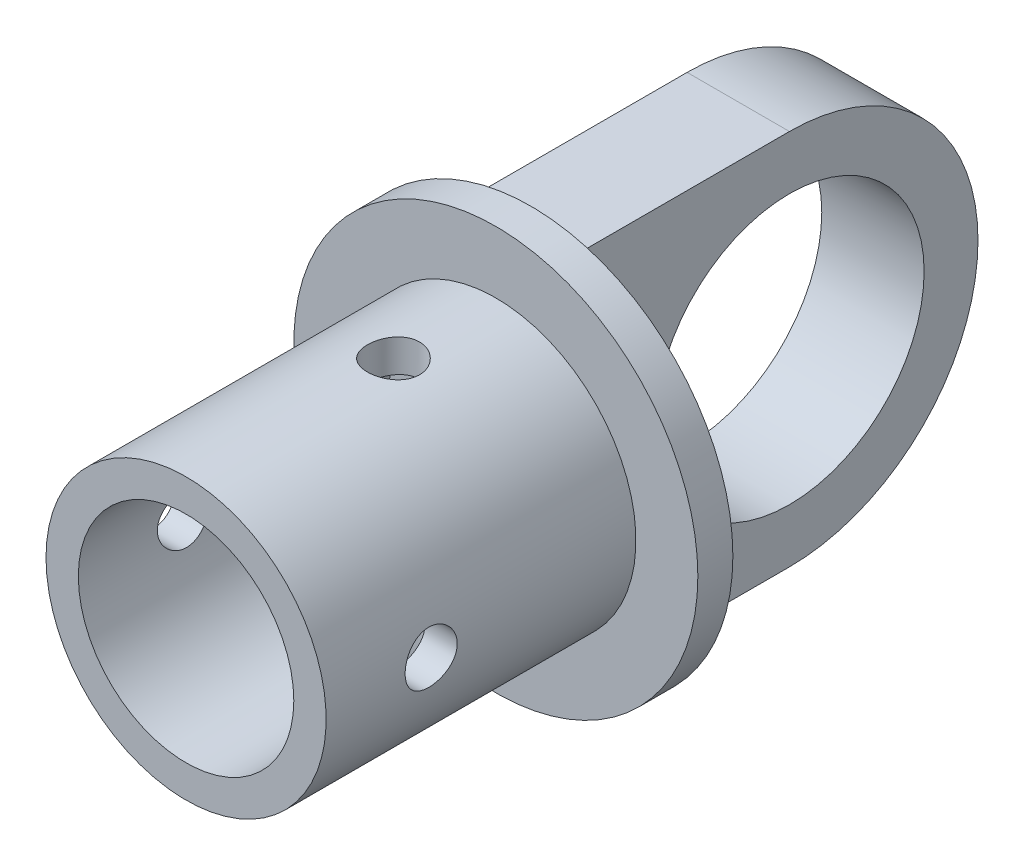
ISO-10303-21;
HEADER;
FILE_DESCRIPTION(('STEP AP214'),'2;1');
FILE_NAME('part.step','',(''),(''),'','','');
FILE_SCHEMA(('AUTOMOTIVE_DESIGN { 1 0 10303 214 1 1 1 1 }'));
ENDSEC;
DATA;
#1=APPLICATION_CONTEXT('core data for automotive mechanical design processes');
#2=APPLICATION_PROTOCOL_DEFINITION('international standard','automotive_design',2000,#1);
#3=PRODUCT_CONTEXT('',#1,'mechanical');
#4=PRODUCT('Part','Part','',(#3));
#5=PRODUCT_RELATED_PRODUCT_CATEGORY('part','',(#4));
#6=PRODUCT_DEFINITION_FORMATION('','',#4);
#7=PRODUCT_DEFINITION_CONTEXT('part definition',#1,'design');
#8=PRODUCT_DEFINITION('design','',#6,#7);
#9=PRODUCT_DEFINITION_SHAPE('','',#8);
#10=(LENGTH_UNIT() NAMED_UNIT(*) SI_UNIT(.MILLI.,.METRE.));
#11=(NAMED_UNIT(*) PLANE_ANGLE_UNIT() SI_UNIT($,.RADIAN.));
#12=(NAMED_UNIT(*) SI_UNIT($,.STERADIAN.) SOLID_ANGLE_UNIT());
#13=UNCERTAINTY_MEASURE_WITH_UNIT(LENGTH_MEASURE(1.E-05),#10,'distance_accuracy_value','');
#14=(GEOMETRIC_REPRESENTATION_CONTEXT(3) GLOBAL_UNCERTAINTY_ASSIGNED_CONTEXT((#13)) GLOBAL_UNIT_ASSIGNED_CONTEXT((#10,
#11,#12)) REPRESENTATION_CONTEXT('',''));
#15=CARTESIAN_POINT('',(0.,0.,0.));
#16=DIRECTION('',(0.,0.,1.));
#17=DIRECTION('',(1.,0.,0.));
#18=AXIS2_PLACEMENT_3D('',#15,#16,#17);
#19=CARTESIAN_POINT('',(4.826,0.,-22.86));
#20=DIRECTION('',(1.,0.,0.));
#21=DIRECTION('',(0.,0.,-1.));
#22=AXIS2_PLACEMENT_3D('',#19,#20,#21);
#23=CYLINDRICAL_SURFACE('',#22,12.7);
#24=CARTESIAN_POINT('',(-4.826,0.,-22.86));
#25=DIRECTION('',(1.,0.,0.));
#26=DIRECTION('',(0.,0.,-1.));
#27=AXIS2_PLACEMENT_3D('',#24,#25,#26);
#28=CIRCLE('',#27,12.7);
#29=CARTESIAN_POINT('',(-4.826,0.,-35.56));
#30=VERTEX_POINT('',#29);
#31=EDGE_CURVE('E104',#30,#30,#28,.F.);
#32=ORIENTED_EDGE('',*,*,#31,.T.);
#33=EDGE_LOOP('',(#32));
#34=FACE_BOUND('',#33,.T.);
#35=CARTESIAN_POINT('',(4.826,0.,-22.86));
#36=DIRECTION('',(1.,0.,0.));
#37=DIRECTION('',(0.,0.,-1.));
#38=AXIS2_PLACEMENT_3D('',#35,#36,#37);
#39=CIRCLE('',#38,12.7);
#40=CARTESIAN_POINT('',(4.826,0.,-35.56));
#41=VERTEX_POINT('',#40);
#42=EDGE_CURVE('E17',#41,#41,#39,.F.);
#43=ORIENTED_EDGE('',*,*,#42,.F.);
#44=EDGE_LOOP('',(#43));
#45=FACE_BOUND('',#44,.T.);
#46=ADVANCED_FACE('F14',(#34,#45),#23,.F.);
#47=CARTESIAN_POINT('',(4.826,0.,-22.86));
#48=DIRECTION('',(-1.,0.,0.));
#49=DIRECTION('',(0.,0.,1.));
#50=AXIS2_PLACEMENT_3D('',#47,#48,#49);
#51=CYLINDRICAL_SURFACE('',#50,17.78);
#52=CARTESIAN_POINT('',(4.826,0.,-22.86));
#53=DIRECTION('',(-1.,0.,0.));
#54=DIRECTION('',(0.,0.,1.));
#55=AXIS2_PLACEMENT_3D('',#52,#53,#54);
#56=CIRCLE('',#55,17.78);
#57=CARTESIAN_POINT('',(4.826,-17.78,-22.86));
#58=VERTEX_POINT('',#57);
#59=CARTESIAN_POINT('',(4.826,17.78,-22.86));
#60=VERTEX_POINT('',#59);
#61=EDGE_CURVE('E53',#58,#60,#56,.F.);
#62=ORIENTED_EDGE('',*,*,#61,.F.);
#63=DIRECTION('',(1.,0.,0.));
#64=VECTOR('',#63,1.);
#65=CARTESIAN_POINT('',(4.826,-17.78,-22.86));
#66=LINE('',#65,#64);
#67=CARTESIAN_POINT('',(-4.826,-17.78,-22.86));
#68=VERTEX_POINT('',#67);
#69=EDGE_CURVE('E57',#58,#68,#66,.F.);
#70=ORIENTED_EDGE('',*,*,#69,.T.);
#71=CARTESIAN_POINT('',(-4.826,0.,-22.86));
#72=DIRECTION('',(-1.,0.,0.));
#73=DIRECTION('',(0.,0.,1.));
#74=AXIS2_PLACEMENT_3D('',#71,#72,#73);
#75=CIRCLE('',#74,17.78);
#76=CARTESIAN_POINT('',(-4.826,17.78,-22.86));
#77=VERTEX_POINT('',#76);
#78=EDGE_CURVE('E167',#68,#77,#75,.F.);
#79=ORIENTED_EDGE('',*,*,#78,.T.);
#80=DIRECTION('',(1.,0.,0.));
#81=VECTOR('',#80,1.);
#82=CARTESIAN_POINT('',(4.826,17.78,-22.86));
#83=LINE('',#82,#81);
#84=EDGE_CURVE('E59',#77,#60,#83,.T.);
#85=ORIENTED_EDGE('',*,*,#84,.T.);
#86=EDGE_LOOP('',(#62,#70,#79,#85));
#87=FACE_BOUND('',#86,.T.);
#88=ADVANCED_FACE('F55',(#87),#51,.T.);
#89=CARTESIAN_POINT('',(4.826,0.,-22.86));
#90=DIRECTION('',(1.,0.,0.));
#91=DIRECTION('',(0.,0.,-1.));
#92=AXIS2_PLACEMENT_3D('',#89,#90,#91);
#93=PLANE('',#92);
#94=ORIENTED_EDGE('',*,*,#61,.T.);
#95=DIRECTION('',(0.,0.,-1.));
#96=VECTOR('',#95,1.);
#97=CARTESIAN_POINT('',(4.826,17.78,-3.302));
#98=LINE('',#97,#96);
#99=CARTESIAN_POINT('',(4.826,17.78,-3.302));
#100=VERTEX_POINT('',#99);
#101=EDGE_CURVE('E98',#60,#100,#98,.F.);
#102=ORIENTED_EDGE('',*,*,#101,.T.);
#103=DIRECTION('',(0.,1.,0.));
#104=VECTOR('',#103,1.);
#105=CARTESIAN_POINT('',(4.826,0.,-3.302));
#106=LINE('',#105,#104);
#107=CARTESIAN_POINT('',(4.826,-17.78,-3.302));
#108=VERTEX_POINT('',#107);
#109=EDGE_CURVE('E67',#108,#100,#106,.T.);
#110=ORIENTED_EDGE('',*,*,#109,.F.);
#111=DIRECTION('',(0.,0.,1.));
#112=VECTOR('',#111,1.);
#113=CARTESIAN_POINT('',(4.826,-17.78,-3.302));
#114=LINE('',#113,#112);
#115=EDGE_CURVE('E63',#108,#58,#114,.F.);
#116=ORIENTED_EDGE('',*,*,#115,.T.);
#117=EDGE_LOOP('',(#94,#102,#110,#116));
#118=FACE_BOUND('',#117,.T.);
#119=ORIENTED_EDGE('',*,*,#42,.T.);
#120=EDGE_LOOP('',(#119));
#121=FACE_BOUND('',#120,.T.);
#122=ADVANCED_FACE('F64',(#118,#121),#93,.T.);
#123=CARTESIAN_POINT('',(4.826,17.78,-3.302));
#124=DIRECTION('',(0.,-1.,0.));
#125=DIRECTION('',(0.,0.,-1.));
#126=AXIS2_PLACEMENT_3D('',#123,#124,#125);
#127=PLANE('',#126);
#128=DIRECTION('',(-1.,0.,0.));
#129=VECTOR('',#128,1.);
#130=CARTESIAN_POINT('',(0.,17.78,-3.302));
#131=LINE('',#130,#129);
#132=CARTESIAN_POINT('',(-4.826,17.78,-3.302));
#133=VERTEX_POINT('',#132);
#134=EDGE_CURVE('E89',#100,#133,#131,.T.);
#135=ORIENTED_EDGE('',*,*,#134,.F.);
#136=ORIENTED_EDGE('',*,*,#101,.F.);
#137=ORIENTED_EDGE('',*,*,#84,.F.);
#138=DIRECTION('',(0.,0.,-1.));
#139=VECTOR('',#138,1.);
#140=CARTESIAN_POINT('',(-4.826,17.78,-22.86));
#141=LINE('',#140,#139);
#142=EDGE_CURVE('E70',#77,#133,#141,.F.);
#143=ORIENTED_EDGE('',*,*,#142,.T.);
#144=EDGE_LOOP('',(#135,#136,#137,#143));
#145=FACE_BOUND('',#144,.T.);
#146=ADVANCED_FACE('F176',(#145),#127,.F.);
#147=CARTESIAN_POINT('',(-4.826,0.,-22.86));
#148=DIRECTION('',(1.,0.,0.));
#149=DIRECTION('',(0.,0.,-1.));
#150=AXIS2_PLACEMENT_3D('',#147,#148,#149);
#151=PLANE('',#150);
#152=ORIENTED_EDGE('',*,*,#142,.F.);
#153=ORIENTED_EDGE('',*,*,#78,.F.);
#154=DIRECTION('',(0.,0.,1.));
#155=VECTOR('',#154,1.);
#156=CARTESIAN_POINT('',(-4.826,-17.78,-3.302));
#157=LINE('',#156,#155);
#158=CARTESIAN_POINT('',(-4.826,-17.78,-3.302));
#159=VERTEX_POINT('',#158);
#160=EDGE_CURVE('E32',#68,#159,#157,.T.);
#161=ORIENTED_EDGE('',*,*,#160,.T.);
#162=DIRECTION('',(0.,1.,0.));
#163=VECTOR('',#162,1.);
#164=CARTESIAN_POINT('',(-4.826,0.,-3.302));
#165=LINE('',#164,#163);
#166=EDGE_CURVE('E84',#133,#159,#165,.F.);
#167=ORIENTED_EDGE('',*,*,#166,.F.);
#168=EDGE_LOOP('',(#152,#153,#161,#167));
#169=FACE_BOUND('',#168,.T.);
#170=ORIENTED_EDGE('',*,*,#31,.F.);
#171=EDGE_LOOP('',(#170));
#172=FACE_BOUND('',#171,.T.);
#173=ADVANCED_FACE('F174',(#169,#172),#151,.F.);
#174=CARTESIAN_POINT('',(4.826,-17.78,-3.302));
#175=DIRECTION('',(0.,1.,0.));
#176=DIRECTION('',(0.,0.,1.));
#177=AXIS2_PLACEMENT_3D('',#174,#175,#176);
#178=PLANE('',#177);
#179=ORIENTED_EDGE('',*,*,#69,.F.);
#180=ORIENTED_EDGE('',*,*,#115,.F.);
#181=DIRECTION('',(-1.,0.,0.));
#182=VECTOR('',#181,1.);
#183=CARTESIAN_POINT('',(0.,-17.78,-3.302));
#184=LINE('',#183,#182);
#185=EDGE_CURVE('E81',#159,#108,#184,.F.);
#186=ORIENTED_EDGE('',*,*,#185,.F.);
#187=ORIENTED_EDGE('',*,*,#160,.F.);
#188=EDGE_LOOP('',(#179,#180,#186,#187));
#189=FACE_BOUND('',#188,.T.);
#190=ADVANCED_FACE('F72',(#189),#178,.F.);
#191=CARTESIAN_POINT('',(0.,0.,-3.302));
#192=DIRECTION('',(0.,0.,-1.));
#193=DIRECTION('',(-1.,0.,0.));
#194=AXIS2_PLACEMENT_3D('',#191,#192,#193);
#195=PLANE('',#194);
#196=CARTESIAN_POINT('',(0.,0.,-3.302));
#197=DIRECTION('',(0.,0.,1.));
#198=DIRECTION('',(1.,0.,0.));
#199=AXIS2_PLACEMENT_3D('',#196,#197,#198);
#200=CIRCLE('',#199,19.05);
#201=CARTESIAN_POINT('',(19.05,0.,-3.302));
#202=VERTEX_POINT('',#201);
#203=EDGE_CURVE('E83',#202,#202,#200,.T.);
#204=ORIENTED_EDGE('',*,*,#203,.F.);
#205=EDGE_LOOP('',(#204));
#206=FACE_BOUND('',#205,.T.);
#207=ORIENTED_EDGE('',*,*,#166,.T.);
#208=ORIENTED_EDGE('',*,*,#185,.T.);
#209=ORIENTED_EDGE('',*,*,#109,.T.);
#210=ORIENTED_EDGE('',*,*,#134,.T.);
#211=EDGE_LOOP('',(#207,#208,#209,#210));
#212=FACE_BOUND('',#211,.T.);
#213=ADVANCED_FACE('F183',(#206,#212),#195,.T.);
#214=CARTESIAN_POINT('',(0.,0.,0.));
#215=DIRECTION('',(0.,0.,-1.));
#216=DIRECTION('',(-1.,0.,0.));
#217=AXIS2_PLACEMENT_3D('',#214,#215,#216);
#218=PLANE('',#217);
#219=CARTESIAN_POINT('',(0.,0.,0.));
#220=DIRECTION('',(0.,0.,-1.));
#221=DIRECTION('',(-1.,0.,0.));
#222=AXIS2_PLACEMENT_3D('',#219,#220,#221);
#223=CIRCLE('',#222,10.16);
#224=CARTESIAN_POINT('',(-10.16,0.,0.));
#225=VERTEX_POINT('',#224);
#226=EDGE_CURVE('E159',#225,#225,#223,.F.);
#227=ORIENTED_EDGE('',*,*,#226,.T.);
#228=EDGE_LOOP('',(#227));
#229=FACE_BOUND('',#228,.T.);
#230=ADVANCED_FACE('F242',(#229),#218,.F.);
#231=CARTESIAN_POINT('',(0.,0.,-3.302));
#232=DIRECTION('',(0.,0.,1.));
#233=DIRECTION('',(1.,0.,0.));
#234=AXIS2_PLACEMENT_3D('',#231,#232,#233);
#235=CYLINDRICAL_SURFACE('',#234,19.05);
#236=ORIENTED_EDGE('',*,*,#203,.T.);
#237=EDGE_LOOP('',(#236));
#238=FACE_BOUND('',#237,.T.);
#239=CARTESIAN_POINT('',(0.,0.,0.));
#240=DIRECTION('',(0.,0.,1.));
#241=DIRECTION('',(1.,0.,0.));
#242=AXIS2_PLACEMENT_3D('',#239,#240,#241);
#243=CIRCLE('',#242,19.05);
#244=CARTESIAN_POINT('',(19.05,0.,0.));
#245=VERTEX_POINT('',#244);
#246=EDGE_CURVE('E335',#245,#245,#243,.F.);
#247=ORIENTED_EDGE('',*,*,#246,.T.);
#248=EDGE_LOOP('',(#247));
#249=FACE_BOUND('',#248,.T.);
#250=ADVANCED_FACE('F251',(#238,#249),#235,.T.);
#251=CARTESIAN_POINT('',(0.,0.,29.21));
#252=DIRECTION('',(0.,0.,-1.));
#253=DIRECTION('',(-1.,0.,0.));
#254=AXIS2_PLACEMENT_3D('',#251,#252,#253);
#255=CYLINDRICAL_SURFACE('',#254,10.16);
#256=ORIENTED_EDGE('',*,*,#226,.F.);
#257=EDGE_LOOP('',(#256));
#258=FACE_BOUND('',#257,.T.);
#259=CARTESIAN_POINT('',(-10.16,0.,21.76145));
#260=CARTESIAN_POINT('',(-10.1599961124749,0.135762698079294,21.7614431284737));
#261=CARTESIAN_POINT('',(-10.1572485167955,0.271686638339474,21.7501500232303));
#262=CARTESIAN_POINT('',(-10.1465428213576,0.539767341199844,21.7053013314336));
#263=CARTESIAN_POINT('',(-10.1385748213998,0.671916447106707,21.6717034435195));
#264=CARTESIAN_POINT('',(-10.1183133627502,0.928358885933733,21.58337746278));
#265=CARTESIAN_POINT('',(-10.1060270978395,1.05266488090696,21.5286844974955));
#266=CARTESIAN_POINT('',(-10.0784455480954,1.290295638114,21.3998221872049));
#267=CARTESIAN_POINT('',(-10.0631510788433,1.40362336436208,21.3256581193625));
#268=CARTESIAN_POINT('',(-10.0308819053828,1.61833667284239,21.1584230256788));
#269=CARTESIAN_POINT('',(-10.0138824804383,1.71947855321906,21.0650438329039));
#270=CARTESIAN_POINT('',(-9.98028561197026,1.90483411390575,20.8626850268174));
#271=CARTESIAN_POINT('',(-9.96368823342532,1.98904507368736,20.7537029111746));
#272=CARTESIAN_POINT('',(-9.93253008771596,2.13925944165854,20.5213830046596));
#273=CARTESIAN_POINT('',(-9.91800052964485,2.2049960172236,20.3978681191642));
#274=CARTESIAN_POINT('',(-9.89297946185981,2.31468005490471,20.1411342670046));
#275=CARTESIAN_POINT('',(-9.8824873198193,2.35863092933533,20.0079168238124));
#276=CARTESIAN_POINT('',(-9.8669806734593,2.42267788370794,19.7382110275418));
#277=CARTESIAN_POINT('',(-9.86186676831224,2.44320746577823,19.6018314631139));
#278=CARTESIAN_POINT('',(-9.85739782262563,2.46117873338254,19.3274752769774));
#279=CARTESIAN_POINT('',(-9.85804191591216,2.45862389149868,19.1894988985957));
#280=CARTESIAN_POINT('',(-9.86492664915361,2.43084557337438,18.9191618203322));
#281=CARTESIAN_POINT('',(-9.87104059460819,2.40613524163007,18.7867446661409));
#282=CARTESIAN_POINT('',(-9.88797474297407,2.33556412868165,18.5279923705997));
#283=CARTESIAN_POINT('',(-9.89879529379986,2.28970178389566,18.4016576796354));
#284=CARTESIAN_POINT('',(-9.92404241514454,2.17768057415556,18.1572599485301));
#285=CARTESIAN_POINT('',(-9.93850246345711,2.11133190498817,18.039287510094));
#286=CARTESIAN_POINT('',(-9.96937869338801,1.96035912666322,17.8159730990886));
#287=CARTESIAN_POINT('',(-9.98579506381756,1.87573325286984,17.7106323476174));
#288=CARTESIAN_POINT('',(-10.0192684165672,1.68795028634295,17.5126351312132));
#289=CARTESIAN_POINT('',(-10.0363308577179,1.58436222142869,17.4203878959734));
#290=CARTESIAN_POINT('',(-10.0687887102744,1.36293605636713,17.2544613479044));
#291=CARTESIAN_POINT('',(-10.0841834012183,1.24509184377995,17.1807900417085));
#292=CARTESIAN_POINT('',(-10.1116420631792,0.997904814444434,17.0539722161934));
#293=CARTESIAN_POINT('',(-10.1236931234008,0.868519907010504,17.0009049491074));
#294=CARTESIAN_POINT('',(-10.1429935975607,0.602469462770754,16.9174860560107));
#295=CARTESIAN_POINT('',(-10.1502530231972,0.465819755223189,16.8870870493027));
#296=CARTESIAN_POINT('',(-10.1564680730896,0.273382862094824,16.8611867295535));
#297=CARTESIAN_POINT('',(-10.157789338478,0.218866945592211,16.8557031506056));
#298=CARTESIAN_POINT('',(-10.159556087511,0.109576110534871,16.8483833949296));
#299=CARTESIAN_POINT('',(-10.1600015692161,0.0548011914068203,16.8465472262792));
#300=CARTESIAN_POINT('',(-10.1599961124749,-0.135762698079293,16.8465568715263));
#301=CARTESIAN_POINT('',(-10.1572485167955,-0.271686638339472,16.8578499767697));
#302=CARTESIAN_POINT('',(-10.1465428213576,-0.539767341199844,16.9026986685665));
#303=CARTESIAN_POINT('',(-10.1385748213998,-0.671916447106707,16.9362965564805));
#304=CARTESIAN_POINT('',(-10.1183133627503,-0.928358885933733,17.02462253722));
#305=CARTESIAN_POINT('',(-10.1060270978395,-1.05266488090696,17.0793155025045));
#306=CARTESIAN_POINT('',(-10.0784455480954,-1.290295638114,17.2081778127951));
#307=CARTESIAN_POINT('',(-10.0631510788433,-1.40362336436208,17.2823418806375));
#308=CARTESIAN_POINT('',(-10.0308819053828,-1.61833667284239,17.4495769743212));
#309=CARTESIAN_POINT('',(-10.0138824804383,-1.71947855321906,17.5429561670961));
#310=CARTESIAN_POINT('',(-9.98028561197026,-1.90483411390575,17.7453149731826));
#311=CARTESIAN_POINT('',(-9.96368823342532,-1.98904507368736,17.8542970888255));
#312=CARTESIAN_POINT('',(-9.93253008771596,-2.13925944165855,18.0866169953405));
#313=CARTESIAN_POINT('',(-9.91800052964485,-2.2049960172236,18.2101318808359));
#314=CARTESIAN_POINT('',(-9.89297946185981,-2.31468005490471,18.4668657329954));
#315=CARTESIAN_POINT('',(-9.8824873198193,-2.35863092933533,18.6000831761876));
#316=CARTESIAN_POINT('',(-9.8669806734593,-2.42267788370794,18.8697889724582));
#317=CARTESIAN_POINT('',(-9.86186676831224,-2.44320746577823,19.0061685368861));
#318=CARTESIAN_POINT('',(-9.85739782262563,-2.46117873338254,19.2805247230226));
#319=CARTESIAN_POINT('',(-9.85804191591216,-2.45862389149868,19.4185011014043));
#320=CARTESIAN_POINT('',(-9.86492664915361,-2.43084557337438,19.6888381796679));
#321=CARTESIAN_POINT('',(-9.87104059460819,-2.40613524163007,19.8212553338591));
#322=CARTESIAN_POINT('',(-9.88797474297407,-2.33556412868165,20.0800076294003));
#323=CARTESIAN_POINT('',(-9.89879529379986,-2.28970178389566,20.2063423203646));
#324=CARTESIAN_POINT('',(-9.92404241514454,-2.17768057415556,20.4507400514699));
#325=CARTESIAN_POINT('',(-9.93850246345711,-2.11133190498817,20.568712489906));
#326=CARTESIAN_POINT('',(-9.96937869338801,-1.96035912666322,20.7920269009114));
#327=CARTESIAN_POINT('',(-9.98579506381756,-1.87573325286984,20.8973676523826));
#328=CARTESIAN_POINT('',(-10.0192684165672,-1.68795028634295,21.0953648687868));
#329=CARTESIAN_POINT('',(-10.0363308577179,-1.58436222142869,21.1876121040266));
#330=CARTESIAN_POINT('',(-10.0687887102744,-1.36293605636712,21.3535386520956));
#331=CARTESIAN_POINT('',(-10.0841834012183,-1.24509184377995,21.4272099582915));
#332=CARTESIAN_POINT('',(-10.1116420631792,-0.997904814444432,21.5540277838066));
#333=CARTESIAN_POINT('',(-10.1236931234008,-0.868519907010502,21.6070950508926));
#334=CARTESIAN_POINT('',(-10.1429935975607,-0.602469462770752,21.6905139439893));
#335=CARTESIAN_POINT('',(-10.1502530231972,-0.465819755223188,21.7209129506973));
#336=CARTESIAN_POINT('',(-10.1564680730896,-0.273382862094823,21.7468132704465));
#337=CARTESIAN_POINT('',(-10.157789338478,-0.21886694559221,21.7522968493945));
#338=CARTESIAN_POINT('',(-10.159556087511,-0.10957611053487,21.7596166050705));
#339=CARTESIAN_POINT('',(-10.1600015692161,-0.0548011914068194,21.7614527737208));
#340=CARTESIAN_POINT('',(-10.16,0.,21.76145));
#341=B_SPLINE_CURVE_WITH_KNOTS('',3,(#259,#260,#261,#262,#263,#264,#265,#266,#267,#268,#269,
#270,#271,#272,#273,#274,#275,#276,#277,#278,#279,#280,#281,#282,#283,#284,#285,#286,#287,#288,
#289,#290,#291,#292,#293,#294,#295,#296,#297,#298,#299,#300,#301,#302,#303,#304,#305,#306,#307,
#308,#309,#310,#311,#312,#313,#314,#315,#316,#317,#318,#319,#320,#321,#322,#323,#324,#325,#326,
#327,#328,#329,#330,#331,#332,#333,#334,#335,#336,#337,#338,#339,#340),.UNSPECIFIED.,.T.,.F.,(4,
2,2,2,2,2,2,2,2,2,2,2,2,2,2,2,2,2,2,2,2,2,2,2,2,2,2,2,2,2,2,2,2,2,2,2,2,2,2,2,4),(0.,
0.407078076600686,0.814930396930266,1.22210647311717,1.62917230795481,2.04336199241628,
2.45761817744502,2.87758163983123,3.29747930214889,3.70947218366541,4.12140309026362,
4.52403288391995,4.92669244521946,5.33320062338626,5.73974806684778,6.15704943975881,
6.57453037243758,6.993601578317,7.41179437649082,7.57611281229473,7.74043161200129,
8.14750968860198,8.55536200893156,8.96253808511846,9.3696039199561,9.78379360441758,
10.1980497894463,10.6180132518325,11.0379109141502,11.4499037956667,11.8618347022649,
12.2644644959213,12.6671240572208,13.0736322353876,13.4801796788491,13.8974810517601,
14.3149619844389,14.7340331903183,15.1522259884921,15.316544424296,15.4808632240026),.UNSPECIFIED.);
#342=CARTESIAN_POINT('',(-10.16,0.,21.76145));
#343=VERTEX_POINT('',#342);
#344=EDGE_CURVE('E135',#343,#343,#341,.T.);
#345=ORIENTED_EDGE('',*,*,#344,.T.);
#346=EDGE_LOOP('',(#345));
#347=FACE_BOUND('',#346,.T.);
#348=CARTESIAN_POINT('',(0.,0.,29.21));
#349=DIRECTION('',(0.,0.,-1.));
#350=DIRECTION('',(-1.,0.,0.));
#351=AXIS2_PLACEMENT_3D('',#348,#349,#350);
#352=CIRCLE('',#351,10.16);
#353=CARTESIAN_POINT('',(-10.16,0.,29.21));
#354=VERTEX_POINT('',#353);
#355=EDGE_CURVE('E341',#354,#354,#352,.T.);
#356=ORIENTED_EDGE('',*,*,#355,.F.);
#357=EDGE_LOOP('',(#356));
#358=FACE_BOUND('',#357,.T.);
#359=CARTESIAN_POINT('',(0.,10.16,12.10945));
#360=CARTESIAN_POINT('',(0.135762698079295,10.1599961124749,12.1094431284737));
#361=CARTESIAN_POINT('',(0.271686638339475,10.1572485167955,12.0981500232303));
#362=CARTESIAN_POINT('',(0.539767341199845,10.1465428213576,12.0533013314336));
#363=CARTESIAN_POINT('',(0.671916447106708,10.1385748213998,12.0197034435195));
#364=CARTESIAN_POINT('',(0.928358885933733,10.1183133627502,11.93137746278));
#365=CARTESIAN_POINT('',(1.05266488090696,10.1060270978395,11.8766844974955));
#366=CARTESIAN_POINT('',(1.29029563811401,10.0784455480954,11.7478221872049));
#367=CARTESIAN_POINT('',(1.40362336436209,10.0631510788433,11.6736581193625));
#368=CARTESIAN_POINT('',(1.61833667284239,10.0308819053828,11.5064230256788));
#369=CARTESIAN_POINT('',(1.71947855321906,10.0138824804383,11.4130438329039));
#370=CARTESIAN_POINT('',(1.90483411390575,9.98028561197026,11.2106850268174));
#371=CARTESIAN_POINT('',(1.98904507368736,9.96368823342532,11.1017029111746));
#372=CARTESIAN_POINT('',(2.13925944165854,9.93253008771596,10.8693830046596));
#373=CARTESIAN_POINT('',(2.2049960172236,9.91800052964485,10.7458681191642));
#374=CARTESIAN_POINT('',(2.31468005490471,9.89297946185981,10.4891342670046));
#375=CARTESIAN_POINT('',(2.35863092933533,9.8824873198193,10.3559168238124));
#376=CARTESIAN_POINT('',(2.42267788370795,9.8669806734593,10.0862110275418));
#377=CARTESIAN_POINT('',(2.44320746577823,9.86186676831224,9.94983146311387));
#378=CARTESIAN_POINT('',(2.46117873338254,9.85739782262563,9.67547527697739));
#379=CARTESIAN_POINT('',(2.45862389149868,9.85804191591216,9.53749889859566));
#380=CARTESIAN_POINT('',(2.43084557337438,9.8649266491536,9.26716182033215));
#381=CARTESIAN_POINT('',(2.40613524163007,9.87104059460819,9.13474466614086));
#382=CARTESIAN_POINT('',(2.33556412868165,9.88797474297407,8.87599237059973));
#383=CARTESIAN_POINT('',(2.28970178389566,9.89879529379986,8.74965767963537));
#384=CARTESIAN_POINT('',(2.17768057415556,9.92404241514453,8.50525994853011));
#385=CARTESIAN_POINT('',(2.11133190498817,9.93850246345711,8.38728751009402));
#386=CARTESIAN_POINT('',(1.96035912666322,9.96937869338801,8.16397309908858));
#387=CARTESIAN_POINT('',(1.87573325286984,9.98579506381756,8.05863234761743));
#388=CARTESIAN_POINT('',(1.68795028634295,10.0192684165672,7.8606351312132));
#389=CARTESIAN_POINT('',(1.58436222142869,10.0363308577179,7.7683878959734));
#390=CARTESIAN_POINT('',(1.36293605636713,10.0687887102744,7.60246134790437));
#391=CARTESIAN_POINT('',(1.24509184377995,10.0841834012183,7.52879004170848));
#392=CARTESIAN_POINT('',(0.997904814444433,10.1116420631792,7.4019722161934));
#393=CARTESIAN_POINT('',(0.868519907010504,10.1236931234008,7.34890494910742));
#394=CARTESIAN_POINT('',(0.602469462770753,10.1429935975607,7.26548605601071));
#395=CARTESIAN_POINT('',(0.465819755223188,10.1502530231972,7.23508704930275));
#396=CARTESIAN_POINT('',(0.273382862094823,10.1564680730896,7.20918672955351));
#397=CARTESIAN_POINT('',(0.21886694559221,10.157789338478,7.20370315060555));
#398=CARTESIAN_POINT('',(0.10957611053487,10.159556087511,7.19638339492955));
#399=CARTESIAN_POINT('',(0.0548011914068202,10.1600015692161,7.19454722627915));
#400=CARTESIAN_POINT('',(-0.135762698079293,10.1599961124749,7.19455687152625));
#401=CARTESIAN_POINT('',(-0.271686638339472,10.1572485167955,7.2058499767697));
#402=CARTESIAN_POINT('',(-0.539767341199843,10.1465428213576,7.25069866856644));
#403=CARTESIAN_POINT('',(-0.671916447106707,10.1385748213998,7.28429655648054));
#404=CARTESIAN_POINT('',(-0.928358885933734,10.1183133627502,7.37262253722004));
#405=CARTESIAN_POINT('',(-1.05266488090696,10.1060270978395,7.42731550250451));
#406=CARTESIAN_POINT('',(-1.29029563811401,10.0784455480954,7.5561778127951));
#407=CARTESIAN_POINT('',(-1.40362336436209,10.0631510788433,7.63034188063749));
#408=CARTESIAN_POINT('',(-1.61833667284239,10.0308819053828,7.79757697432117));
#409=CARTESIAN_POINT('',(-1.71947855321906,10.0138824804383,7.89095616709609));
#410=CARTESIAN_POINT('',(-1.90483411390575,9.98028561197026,8.09331497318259));
#411=CARTESIAN_POINT('',(-1.98904507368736,9.96368823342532,8.20229708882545));
#412=CARTESIAN_POINT('',(-2.13925944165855,9.93253008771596,8.43461699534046));
#413=CARTESIAN_POINT('',(-2.2049960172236,9.91800052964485,8.55813188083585));
#414=CARTESIAN_POINT('',(-2.31468005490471,9.89297946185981,8.81486573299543));
#415=CARTESIAN_POINT('',(-2.35863092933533,9.8824873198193,8.94808317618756));
#416=CARTESIAN_POINT('',(-2.42267788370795,9.8669806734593,9.21778897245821));
#417=CARTESIAN_POINT('',(-2.44320746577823,9.86186676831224,9.35416853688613));
#418=CARTESIAN_POINT('',(-2.46117873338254,9.85739782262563,9.62852472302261));
#419=CARTESIAN_POINT('',(-2.45862389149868,9.85804191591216,9.76650110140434));
#420=CARTESIAN_POINT('',(-2.43084557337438,9.8649266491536,10.0368381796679));
#421=CARTESIAN_POINT('',(-2.40613524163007,9.87104059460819,10.1692553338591));
#422=CARTESIAN_POINT('',(-2.33556412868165,9.88797474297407,10.4280076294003));
#423=CARTESIAN_POINT('',(-2.28970178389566,9.89879529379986,10.5543423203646));
#424=CARTESIAN_POINT('',(-2.17768057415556,9.92404241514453,10.7987400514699));
#425=CARTESIAN_POINT('',(-2.11133190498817,9.93850246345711,10.916712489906));
#426=CARTESIAN_POINT('',(-1.96035912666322,9.96937869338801,11.1400269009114));
#427=CARTESIAN_POINT('',(-1.87573325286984,9.98579506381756,11.2453676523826));
#428=CARTESIAN_POINT('',(-1.68795028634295,10.0192684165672,11.4433648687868));
#429=CARTESIAN_POINT('',(-1.58436222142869,10.0363308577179,11.5356121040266));
#430=CARTESIAN_POINT('',(-1.36293605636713,10.0687887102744,11.7015386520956));
#431=CARTESIAN_POINT('',(-1.24509184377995,10.0841834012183,11.7752099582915));
#432=CARTESIAN_POINT('',(-0.997904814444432,10.1116420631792,11.9020277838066));
#433=CARTESIAN_POINT('',(-0.868519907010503,10.1236931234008,11.9550950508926));
#434=CARTESIAN_POINT('',(-0.602469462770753,10.1429935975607,12.0385139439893));
#435=CARTESIAN_POINT('',(-0.465819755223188,10.1502530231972,12.0689129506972));
#436=CARTESIAN_POINT('',(-0.273382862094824,10.1564680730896,12.0948132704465));
#437=CARTESIAN_POINT('',(-0.218866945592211,10.157789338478,12.1002968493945));
#438=CARTESIAN_POINT('',(-0.109576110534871,10.159556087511,12.1076166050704));
#439=CARTESIAN_POINT('',(-0.0548011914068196,10.1600015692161,12.1094527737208));
#440=CARTESIAN_POINT('',(0.,10.16,12.10945));
#441=B_SPLINE_CURVE_WITH_KNOTS('',3,(#359,#360,#361,#362,#363,#364,#365,#366,#367,#368,#369,
#370,#371,#372,#373,#374,#375,#376,#377,#378,#379,#380,#381,#382,#383,#384,#385,#386,#387,#388,
#389,#390,#391,#392,#393,#394,#395,#396,#397,#398,#399,#400,#401,#402,#403,#404,#405,#406,#407,
#408,#409,#410,#411,#412,#413,#414,#415,#416,#417,#418,#419,#420,#421,#422,#423,#424,#425,#426,
#427,#428,#429,#430,#431,#432,#433,#434,#435,#436,#437,#438,#439,#440),.UNSPECIFIED.,.T.,.F.,(4,
2,2,2,2,2,2,2,2,2,2,2,2,2,2,2,2,2,2,2,2,2,2,2,2,2,2,2,2,2,2,2,2,2,2,2,2,2,2,2,4),(0.,
0.407078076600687,0.814930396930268,1.22210647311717,1.62917230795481,2.04336199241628,
2.45761817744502,2.87758163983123,3.2974793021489,3.70947218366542,4.12140309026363,
4.52403288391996,4.92669244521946,5.33320062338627,5.73974806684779,6.15704943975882,
6.57453037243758,6.993601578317,7.41179437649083,7.57611281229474,7.7404316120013,
8.14750968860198,8.55536200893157,8.96253808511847,9.36960391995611,9.78379360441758,
10.1980497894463,10.6180132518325,11.0379109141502,11.4499037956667,11.8618347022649,
12.2644644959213,12.6671240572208,13.0736322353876,13.4801796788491,13.8974810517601,
14.3149619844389,14.7340331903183,15.1522259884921,15.316544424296,15.4808632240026),.UNSPECIFIED.);
#442=CARTESIAN_POINT('',(0.,10.16,12.10945));
#443=VERTEX_POINT('',#442);
#444=EDGE_CURVE('E158',#443,#443,#441,.T.);
#445=ORIENTED_EDGE('',*,*,#444,.T.);
#446=EDGE_LOOP('',(#445));
#447=FACE_BOUND('',#446,.T.);
#448=CARTESIAN_POINT('',(10.16,0.,16.84655));
#449=CARTESIAN_POINT('',(10.1599961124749,0.135762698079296,16.8465568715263));
#450=CARTESIAN_POINT('',(10.1572485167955,0.271686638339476,16.8578499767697));
#451=CARTESIAN_POINT('',(10.1465428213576,0.539767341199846,16.9026986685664));
#452=CARTESIAN_POINT('',(10.1385748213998,0.671916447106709,16.9362965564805));
#453=CARTESIAN_POINT('',(10.1183133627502,0.928358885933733,17.02462253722));
#454=CARTESIAN_POINT('',(10.1060270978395,1.05266488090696,17.0793155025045));
#455=CARTESIAN_POINT('',(10.0784455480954,1.29029563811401,17.2081778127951));
#456=CARTESIAN_POINT('',(10.0631510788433,1.40362336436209,17.2823418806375));
#457=CARTESIAN_POINT('',(10.0308819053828,1.61833667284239,17.4495769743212));
#458=CARTESIAN_POINT('',(10.0138824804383,1.71947855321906,17.5429561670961));
#459=CARTESIAN_POINT('',(9.98028561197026,1.90483411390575,17.7453149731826));
#460=CARTESIAN_POINT('',(9.96368823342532,1.98904507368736,17.8542970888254));
#461=CARTESIAN_POINT('',(9.93253008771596,2.13925944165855,18.0866169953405));
#462=CARTESIAN_POINT('',(9.91800052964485,2.2049960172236,18.2101318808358));
#463=CARTESIAN_POINT('',(9.89297946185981,2.31468005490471,18.4668657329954));
#464=CARTESIAN_POINT('',(9.8824873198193,2.35863092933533,18.6000831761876));
#465=CARTESIAN_POINT('',(9.8669806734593,2.42267788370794,18.8697889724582));
#466=CARTESIAN_POINT('',(9.86186676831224,2.44320746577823,19.0061685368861));
#467=CARTESIAN_POINT('',(9.85739782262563,2.46117873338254,19.2805247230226));
#468=CARTESIAN_POINT('',(9.85804191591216,2.45862389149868,19.4185011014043));
#469=CARTESIAN_POINT('',(9.86492664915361,2.43084557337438,19.6888381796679));
#470=CARTESIAN_POINT('',(9.87104059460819,2.40613524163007,19.8212553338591));
#471=CARTESIAN_POINT('',(9.88797474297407,2.33556412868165,20.0800076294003));
#472=CARTESIAN_POINT('',(9.89879529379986,2.28970178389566,20.2063423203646));
#473=CARTESIAN_POINT('',(9.92404241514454,2.17768057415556,20.4507400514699));
#474=CARTESIAN_POINT('',(9.93850246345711,2.11133190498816,20.568712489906));
#475=CARTESIAN_POINT('',(9.96937869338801,1.96035912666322,20.7920269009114));
#476=CARTESIAN_POINT('',(9.98579506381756,1.87573325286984,20.8973676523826));
#477=CARTESIAN_POINT('',(10.0192684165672,1.68795028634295,21.0953648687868));
#478=CARTESIAN_POINT('',(10.0363308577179,1.58436222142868,21.1876121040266));
#479=CARTESIAN_POINT('',(10.0687887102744,1.36293605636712,21.3535386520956));
#480=CARTESIAN_POINT('',(10.0841834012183,1.24509184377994,21.4272099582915));
#481=CARTESIAN_POINT('',(10.1116420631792,0.99790481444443,21.5540277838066));
#482=CARTESIAN_POINT('',(10.1236931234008,0.8685199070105,21.6070950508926));
#483=CARTESIAN_POINT('',(10.1429935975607,0.602469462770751,21.6905139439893));
#484=CARTESIAN_POINT('',(10.1502530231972,0.465819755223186,21.7209129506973));
#485=CARTESIAN_POINT('',(10.1564680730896,0.273382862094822,21.7468132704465));
#486=CARTESIAN_POINT('',(10.157789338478,0.218866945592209,21.7522968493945));
#487=CARTESIAN_POINT('',(10.159556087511,0.109576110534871,21.7596166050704));
#488=CARTESIAN_POINT('',(10.1600015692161,0.0548011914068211,21.7614527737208));
#489=CARTESIAN_POINT('',(10.1599961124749,-0.13576269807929,21.7614431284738));
#490=CARTESIAN_POINT('',(10.1572485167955,-0.271686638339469,21.7501500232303));
#491=CARTESIAN_POINT('',(10.1465428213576,-0.539767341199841,21.7053013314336));
#492=CARTESIAN_POINT('',(10.1385748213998,-0.671916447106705,21.6717034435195));
#493=CARTESIAN_POINT('',(10.1183133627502,-0.928358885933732,21.58337746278));
#494=CARTESIAN_POINT('',(10.1060270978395,-1.05266488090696,21.5286844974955));
#495=CARTESIAN_POINT('',(10.0784455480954,-1.290295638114,21.3998221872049));
#496=CARTESIAN_POINT('',(10.0631510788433,-1.40362336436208,21.3256581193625));
#497=CARTESIAN_POINT('',(10.0308819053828,-1.61833667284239,21.1584230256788));
#498=CARTESIAN_POINT('',(10.0138824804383,-1.71947855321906,21.0650438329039));
#499=CARTESIAN_POINT('',(9.98028561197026,-1.90483411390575,20.8626850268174));
#500=CARTESIAN_POINT('',(9.96368823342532,-1.98904507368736,20.7537029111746));
#501=CARTESIAN_POINT('',(9.93253008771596,-2.13925944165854,20.5213830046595));
#502=CARTESIAN_POINT('',(9.91800052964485,-2.2049960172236,20.3978681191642));
#503=CARTESIAN_POINT('',(9.89297946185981,-2.31468005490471,20.1411342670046));
#504=CARTESIAN_POINT('',(9.8824873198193,-2.35863092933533,20.0079168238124));
#505=CARTESIAN_POINT('',(9.8669806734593,-2.42267788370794,19.7382110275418));
#506=CARTESIAN_POINT('',(9.86186676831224,-2.44320746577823,19.6018314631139));
#507=CARTESIAN_POINT('',(9.85739782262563,-2.46117873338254,19.3274752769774));
#508=CARTESIAN_POINT('',(9.85804191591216,-2.45862389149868,19.1894988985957));
#509=CARTESIAN_POINT('',(9.86492664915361,-2.43084557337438,18.9191618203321));
#510=CARTESIAN_POINT('',(9.87104059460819,-2.40613524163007,18.7867446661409));
#511=CARTESIAN_POINT('',(9.88797474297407,-2.33556412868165,18.5279923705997));
#512=CARTESIAN_POINT('',(9.89879529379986,-2.28970178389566,18.4016576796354));
#513=CARTESIAN_POINT('',(9.92404241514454,-2.17768057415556,18.1572599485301));
#514=CARTESIAN_POINT('',(9.93850246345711,-2.11133190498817,18.039287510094));
#515=CARTESIAN_POINT('',(9.96937869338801,-1.96035912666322,17.8159730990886));
#516=CARTESIAN_POINT('',(9.98579506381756,-1.87573325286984,17.7106323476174));
#517=CARTESIAN_POINT('',(10.0192684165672,-1.68795028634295,17.5126351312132));
#518=CARTESIAN_POINT('',(10.0363308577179,-1.58436222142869,17.4203878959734));
#519=CARTESIAN_POINT('',(10.0687887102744,-1.36293605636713,17.2544613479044));
#520=CARTESIAN_POINT('',(10.0841834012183,-1.24509184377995,17.1807900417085));
#521=CARTESIAN_POINT('',(10.1116420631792,-0.997904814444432,17.0539722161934));
#522=CARTESIAN_POINT('',(10.1236931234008,-0.868519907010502,17.0009049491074));
#523=CARTESIAN_POINT('',(10.1429935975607,-0.602469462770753,16.9174860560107));
#524=CARTESIAN_POINT('',(10.1502530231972,-0.465819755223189,16.8870870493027));
#525=CARTESIAN_POINT('',(10.1564680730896,-0.273382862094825,16.8611867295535));
#526=CARTESIAN_POINT('',(10.157789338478,-0.218866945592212,16.8557031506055));
#527=CARTESIAN_POINT('',(10.159556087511,-0.10957611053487,16.8483833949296));
#528=CARTESIAN_POINT('',(10.1600015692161,-0.054801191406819,16.8465472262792));
#529=CARTESIAN_POINT('',(10.16,0.,16.84655));
#530=B_SPLINE_CURVE_WITH_KNOTS('',3,(#448,#449,#450,#451,#452,#453,#454,#455,#456,#457,#458,
#459,#460,#461,#462,#463,#464,#465,#466,#467,#468,#469,#470,#471,#472,#473,#474,#475,#476,#477,
#478,#479,#480,#481,#482,#483,#484,#485,#486,#487,#488,#489,#490,#491,#492,#493,#494,#495,#496,
#497,#498,#499,#500,#501,#502,#503,#504,#505,#506,#507,#508,#509,#510,#511,#512,#513,#514,#515,
#516,#517,#518,#519,#520,#521,#522,#523,#524,#525,#526,#527,#528,#529),.UNSPECIFIED.,.T.,.F.,(4,
2,2,2,2,2,2,2,2,2,2,2,2,2,2,2,2,2,2,2,2,2,2,2,2,2,2,2,2,2,2,2,2,2,2,2,2,2,2,2,4),(0.,
0.407078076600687,0.814930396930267,1.22210647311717,1.62917230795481,2.04336199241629,
2.45761817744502,2.87758163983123,3.29747930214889,3.70947218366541,4.12140309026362,
4.52403288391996,4.92669244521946,5.33320062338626,5.73974806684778,6.15704943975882,
6.57453037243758,6.993601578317,7.41179437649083,7.57611281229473,7.74043161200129,
8.14750968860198,8.55536200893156,8.96253808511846,9.3696039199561,9.78379360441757,
10.1980497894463,10.6180132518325,11.0379109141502,11.4499037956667,11.8618347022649,
12.2644644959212,12.6671240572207,13.0736322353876,13.4801796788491,13.8974810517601,
14.3149619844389,14.7340331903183,15.1522259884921,15.316544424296,15.4808632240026),.UNSPECIFIED.);
#531=CARTESIAN_POINT('',(10.16,0.,16.84655));
#532=VERTEX_POINT('',#531);
#533=EDGE_CURVE('E337',#532,#532,#530,.T.);
#534=ORIENTED_EDGE('',*,*,#533,.T.);
#535=EDGE_LOOP('',(#534));
#536=FACE_BOUND('',#535,.T.);
#537=CARTESIAN_POINT('',(0.,-10.16,12.10945));
#538=CARTESIAN_POINT('',(-0.135762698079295,-10.1599961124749,12.1094431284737));
#539=CARTESIAN_POINT('',(-0.271686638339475,-10.1572485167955,12.0981500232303));
#540=CARTESIAN_POINT('',(-0.539767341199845,-10.1465428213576,12.0533013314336));
#541=CARTESIAN_POINT('',(-0.671916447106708,-10.1385748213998,12.0197034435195));
#542=CARTESIAN_POINT('',(-0.928358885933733,-10.1183133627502,11.93137746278));
#543=CARTESIAN_POINT('',(-1.05266488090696,-10.1060270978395,11.8766844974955));
#544=CARTESIAN_POINT('',(-1.290295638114,-10.0784455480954,11.7478221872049));
#545=CARTESIAN_POINT('',(-1.40362336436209,-10.0631510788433,11.6736581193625));
#546=CARTESIAN_POINT('',(-1.61833667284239,-10.0308819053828,11.5064230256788));
#547=CARTESIAN_POINT('',(-1.71947855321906,-10.0138824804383,11.4130438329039));
#548=CARTESIAN_POINT('',(-1.90483411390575,-9.98028561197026,11.2106850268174));
#549=CARTESIAN_POINT('',(-1.98904507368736,-9.96368823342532,11.1017029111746));
#550=CARTESIAN_POINT('',(-2.13925944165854,-9.93253008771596,10.8693830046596));
#551=CARTESIAN_POINT('',(-2.2049960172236,-9.91800052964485,10.7458681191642));
#552=CARTESIAN_POINT('',(-2.31468005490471,-9.89297946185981,10.4891342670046));
#553=CARTESIAN_POINT('',(-2.35863092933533,-9.8824873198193,10.3559168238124));
#554=CARTESIAN_POINT('',(-2.42267788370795,-9.8669806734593,10.0862110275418));
#555=CARTESIAN_POINT('',(-2.44320746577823,-9.86186676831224,9.94983146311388));
#556=CARTESIAN_POINT('',(-2.46117873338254,-9.85739782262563,9.6754752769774));
#557=CARTESIAN_POINT('',(-2.45862389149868,-9.85804191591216,9.53749889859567));
#558=CARTESIAN_POINT('',(-2.43084557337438,-9.86492664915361,9.26716182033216));
#559=CARTESIAN_POINT('',(-2.40613524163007,-9.87104059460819,9.13474466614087));
#560=CARTESIAN_POINT('',(-2.33556412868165,-9.88797474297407,8.87599237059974));
#561=CARTESIAN_POINT('',(-2.28970178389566,-9.89879529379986,8.74965767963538));
#562=CARTESIAN_POINT('',(-2.17768057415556,-9.92404241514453,8.50525994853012));
#563=CARTESIAN_POINT('',(-2.11133190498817,-9.93850246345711,8.38728751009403));
#564=CARTESIAN_POINT('',(-1.96035912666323,-9.96937869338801,8.1639730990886));
#565=CARTESIAN_POINT('',(-1.87573325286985,-9.98579506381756,8.05863234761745));
#566=CARTESIAN_POINT('',(-1.68795028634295,-10.0192684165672,7.86063513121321));
#567=CARTESIAN_POINT('',(-1.58436222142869,-10.0363308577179,7.76838789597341));
#568=CARTESIAN_POINT('',(-1.36293605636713,-10.0687887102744,7.60246134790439));
#569=CARTESIAN_POINT('',(-1.24509184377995,-10.0841834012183,7.52879004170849));
#570=CARTESIAN_POINT('',(-0.997904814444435,-10.1116420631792,7.40197221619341));
#571=CARTESIAN_POINT('',(-0.868519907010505,-10.1236931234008,7.34890494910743));
#572=CARTESIAN_POINT('',(-0.602469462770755,-10.1429935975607,7.26548605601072));
#573=CARTESIAN_POINT('',(-0.46581975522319,-10.1502530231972,7.23508704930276));
#574=CARTESIAN_POINT('',(-0.273382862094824,-10.1564680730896,7.20918672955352));
#575=CARTESIAN_POINT('',(-0.218866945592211,-10.157789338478,7.20370315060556));
#576=CARTESIAN_POINT('',(-0.10957611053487,-10.159556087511,7.19638339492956));
#577=CARTESIAN_POINT('',(-0.0548011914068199,-10.1600015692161,7.19454722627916));
#578=CARTESIAN_POINT('',(0.135762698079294,-10.1599961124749,7.19455687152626));
#579=CARTESIAN_POINT('',(0.271686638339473,-10.1572485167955,7.20584997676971));
#580=CARTESIAN_POINT('',(0.539767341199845,-10.1465428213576,7.25069866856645));
#581=CARTESIAN_POINT('',(0.671916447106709,-10.1385748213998,7.28429655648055));
#582=CARTESIAN_POINT('',(0.928358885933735,-10.1183133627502,7.37262253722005));
#583=CARTESIAN_POINT('',(1.05266488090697,-10.1060270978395,7.42731550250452));
#584=CARTESIAN_POINT('',(1.29029563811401,-10.0784455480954,7.55617781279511));
#585=CARTESIAN_POINT('',(1.40362336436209,-10.0631510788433,7.6303418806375));
#586=CARTESIAN_POINT('',(1.61833667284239,-10.0308819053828,7.79757697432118));
#587=CARTESIAN_POINT('',(1.71947855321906,-10.0138824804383,7.8909561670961));
#588=CARTESIAN_POINT('',(1.90483411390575,-9.98028561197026,8.0933149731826));
#589=CARTESIAN_POINT('',(1.98904507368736,-9.96368823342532,8.20229708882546));
#590=CARTESIAN_POINT('',(2.13925944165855,-9.93253008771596,8.43461699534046));
#591=CARTESIAN_POINT('',(2.2049960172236,-9.91800052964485,8.55813188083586));
#592=CARTESIAN_POINT('',(2.31468005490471,-9.89297946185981,8.81486573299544));
#593=CARTESIAN_POINT('',(2.35863092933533,-9.8824873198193,8.94808317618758));
#594=CARTESIAN_POINT('',(2.42267788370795,-9.8669806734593,9.21778897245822));
#595=CARTESIAN_POINT('',(2.44320746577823,-9.86186676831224,9.35416853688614));
#596=CARTESIAN_POINT('',(2.46117873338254,-9.85739782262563,9.62852472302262));
#597=CARTESIAN_POINT('',(2.45862389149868,-9.85804191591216,9.76650110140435));
#598=CARTESIAN_POINT('',(2.43084557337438,-9.86492664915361,10.0368381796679));
#599=CARTESIAN_POINT('',(2.40613524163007,-9.87104059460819,10.1692553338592));
#600=CARTESIAN_POINT('',(2.33556412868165,-9.88797474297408,10.4280076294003));
#601=CARTESIAN_POINT('',(2.28970178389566,-9.89879529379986,10.5543423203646));
#602=CARTESIAN_POINT('',(2.17768057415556,-9.92404241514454,10.7987400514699));
#603=CARTESIAN_POINT('',(2.11133190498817,-9.93850246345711,10.916712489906));
#604=CARTESIAN_POINT('',(1.96035912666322,-9.96937869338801,11.1400269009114));
#605=CARTESIAN_POINT('',(1.87573325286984,-9.98579506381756,11.2453676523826));
#606=CARTESIAN_POINT('',(1.68795028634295,-10.0192684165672,11.4433648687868));
#607=CARTESIAN_POINT('',(1.58436222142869,-10.0363308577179,11.5356121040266));
#608=CARTESIAN_POINT('',(1.36293605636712,-10.0687887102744,11.7015386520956));
#609=CARTESIAN_POINT('',(1.24509184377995,-10.0841834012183,11.7752099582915));
#610=CARTESIAN_POINT('',(0.99790481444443,-10.1116420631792,11.9020277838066));
#611=CARTESIAN_POINT('',(0.868519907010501,-10.1236931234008,11.9550950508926));
#612=CARTESIAN_POINT('',(0.60246946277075,-10.1429935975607,12.0385139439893));
#613=CARTESIAN_POINT('',(0.465819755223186,-10.1502530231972,12.0689129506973));
#614=CARTESIAN_POINT('',(0.273382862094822,-10.1564680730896,12.0948132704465));
#615=CARTESIAN_POINT('',(0.218866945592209,-10.157789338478,12.1002968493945));
#616=CARTESIAN_POINT('',(0.109576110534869,-10.159556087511,12.1076166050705));
#617=CARTESIAN_POINT('',(0.0548011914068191,-10.1600015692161,12.1094527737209));
#618=CARTESIAN_POINT('',(0.,-10.16,12.10945));
#619=B_SPLINE_CURVE_WITH_KNOTS('',3,(#537,#538,#539,#540,#541,#542,#543,#544,#545,#546,#547,
#548,#549,#550,#551,#552,#553,#554,#555,#556,#557,#558,#559,#560,#561,#562,#563,#564,#565,#566,
#567,#568,#569,#570,#571,#572,#573,#574,#575,#576,#577,#578,#579,#580,#581,#582,#583,#584,#585,
#586,#587,#588,#589,#590,#591,#592,#593,#594,#595,#596,#597,#598,#599,#600,#601,#602,#603,#604,
#605,#606,#607,#608,#609,#610,#611,#612,#613,#614,#615,#616,#617,#618),.UNSPECIFIED.,.T.,.F.,(4,
2,2,2,2,2,2,2,2,2,2,2,2,2,2,2,2,2,2,2,2,2,2,2,2,2,2,2,2,2,2,2,2,2,2,2,2,2,2,2,4),(0.,
0.407078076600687,0.814930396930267,1.22210647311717,1.62917230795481,2.04336199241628,
2.45761817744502,2.87758163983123,3.2974793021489,3.70947218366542,4.12140309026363,
4.52403288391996,4.92669244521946,5.33320062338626,5.73974806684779,6.15704943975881,
6.57453037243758,6.993601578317,7.41179437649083,7.57611281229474,7.7404316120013,
8.14750968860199,8.55536200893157,8.96253808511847,9.36960391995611,9.78379360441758,
10.1980497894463,10.6180132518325,11.0379109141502,11.4499037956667,11.8618347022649,
12.2644644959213,12.6671240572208,13.0736322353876,13.4801796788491,13.8974810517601,
14.3149619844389,14.7340331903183,15.1522259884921,15.316544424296,15.4808632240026),.UNSPECIFIED.);
#620=CARTESIAN_POINT('',(0.,-10.16,12.10945));
#621=VERTEX_POINT('',#620);
#622=EDGE_CURVE('E152',#621,#621,#619,.T.);
#623=ORIENTED_EDGE('',*,*,#622,.T.);
#624=EDGE_LOOP('',(#623));
#625=FACE_BOUND('',#624,.T.);
#626=ADVANCED_FACE('F144',(#258,#347,#358,#447,#536,#625),#255,.F.);
#627=CARTESIAN_POINT('',(0.,13.208,9.652));
#628=DIRECTION('',(0.,1.,0.));
#629=DIRECTION('',(0.,0.,1.));
#630=AXIS2_PLACEMENT_3D('',#627,#628,#629);
#631=CYLINDRICAL_SURFACE('',#630,2.45744999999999);
#632=ORIENTED_EDGE('',*,*,#622,.F.);
#633=EDGE_LOOP('',(#632));
#634=FACE_BOUND('',#633,.T.);
#635=CARTESIAN_POINT('',(0.,-13.208,7.19455000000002));
#636=CARTESIAN_POINT('',(-0.136632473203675,-13.2079970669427,7.19455644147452));
#637=CARTESIAN_POINT('',(-0.27343661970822,-13.2058560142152,7.20599372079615));
#638=CARTESIAN_POINT('',(-0.543297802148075,-13.1975150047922,7.25144181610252));
#639=CARTESIAN_POINT('',(-0.676346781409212,-13.1913069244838,7.2854978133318));
#640=CARTESIAN_POINT('',(-0.93459701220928,-13.175526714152,7.37510879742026));
#641=CARTESIAN_POINT('',(-1.05980852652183,-13.1659590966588,7.43063495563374));
#642=CARTESIAN_POINT('',(-1.29908894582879,-13.1445076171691,7.56153889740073));
#643=CARTESIAN_POINT('',(-1.41316172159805,-13.1326245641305,7.63690975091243));
#644=CARTESIAN_POINT('',(-1.62833958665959,-13.1076941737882,7.80632427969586));
#645=CARTESIAN_POINT('',(-1.72929322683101,-13.0946357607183,7.90055872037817));
#646=CARTESIAN_POINT('',(-1.91405914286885,-13.0689083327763,8.1046194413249));
#647=CARTESIAN_POINT('',(-1.99786929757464,-13.0562393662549,8.21444764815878));
#648=CARTESIAN_POINT('',(-2.14658323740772,-13.0326197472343,8.44762951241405));
#649=CARTESIAN_POINT('',(-2.21133520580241,-13.021683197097,8.57108154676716));
#650=CARTESIAN_POINT('',(-2.31912208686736,-13.0029207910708,8.82734800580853));
#651=CARTESIAN_POINT('',(-2.3621590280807,-12.9950946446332,8.9601615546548));
#652=CARTESIAN_POINT('',(-2.42481451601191,-12.9835492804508,9.22977883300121));
#653=CARTESIAN_POINT('',(-2.44469432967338,-12.9797842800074,9.36651984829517));
#654=CARTESIAN_POINT('',(-2.46128212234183,-12.9766494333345,9.64144457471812));
#655=CARTESIAN_POINT('',(-2.4579921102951,-12.977279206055,9.77962815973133));
#656=CARTESIAN_POINT('',(-2.42854562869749,-12.9828210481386,10.0516232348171));
#657=CARTESIAN_POINT('',(-2.4026861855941,-12.9876774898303,10.1854681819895));
#658=CARTESIAN_POINT('',(-2.32930218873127,-13.001038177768,10.4468872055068));
#659=CARTESIAN_POINT('',(-2.28177655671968,-13.0095426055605,10.5744609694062));
#660=CARTESIAN_POINT('',(-2.16611626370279,-13.029299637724,10.8205895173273));
#661=CARTESIAN_POINT('',(-2.0978607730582,-13.0405682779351,10.9390861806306));
#662=CARTESIAN_POINT('',(-1.94276922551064,-13.0645723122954,11.1630473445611));
#663=CARTESIAN_POINT('',(-1.85593270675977,-13.0773077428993,11.2685115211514));
#664=CARTESIAN_POINT('',(-1.66455838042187,-13.103051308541,11.4651224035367));
#665=CARTESIAN_POINT('',(-1.55976958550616,-13.1160606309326,11.5560247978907));
#666=CARTESIAN_POINT('',(-1.33624655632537,-13.1407127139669,11.7190370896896));
#667=CARTESIAN_POINT('',(-1.21750618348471,-13.1523548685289,11.7911386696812));
#668=CARTESIAN_POINT('',(-0.969165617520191,-13.1729850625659,11.9145324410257));
#669=CARTESIAN_POINT('',(-0.839544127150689,-13.1819677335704,11.965782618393));
#670=CARTESIAN_POINT('',(-0.573495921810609,-13.1962121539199,12.0456115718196));
#671=CARTESIAN_POINT('',(-0.437084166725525,-13.201481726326,12.0742380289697));
#672=CARTESIAN_POINT('',(-0.249713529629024,-13.2057336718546,12.097243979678));
#673=CARTESIAN_POINT('',(-0.199891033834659,-13.2065816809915,12.1018174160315));
#674=CARTESIAN_POINT('',(-0.100053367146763,-13.207715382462,12.1079216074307));
#675=CARTESIAN_POINT('',(-0.0500381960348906,-13.2080010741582,12.1094523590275));
#676=CARTESIAN_POINT('',(0.136632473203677,-13.2079970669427,12.1094435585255));
#677=CARTESIAN_POINT('',(0.273436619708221,-13.2058560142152,12.0980062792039));
#678=CARTESIAN_POINT('',(0.543297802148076,-13.1975150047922,12.0525581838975));
#679=CARTESIAN_POINT('',(0.676346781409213,-13.1913069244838,12.0185021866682));
#680=CARTESIAN_POINT('',(0.934597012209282,-13.175526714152,11.9288912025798));
#681=CARTESIAN_POINT('',(1.05980852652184,-13.1659590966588,11.8733650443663));
#682=CARTESIAN_POINT('',(1.29908894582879,-13.1445076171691,11.7424611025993));
#683=CARTESIAN_POINT('',(1.41316172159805,-13.1326245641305,11.6670902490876));
#684=CARTESIAN_POINT('',(1.62833958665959,-13.1076941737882,11.4976757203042));
#685=CARTESIAN_POINT('',(1.72929322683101,-13.0946357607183,11.4034412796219));
#686=CARTESIAN_POINT('',(1.91405914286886,-13.0689083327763,11.1993805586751));
#687=CARTESIAN_POINT('',(1.99786929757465,-13.0562393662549,11.0895523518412));
#688=CARTESIAN_POINT('',(2.14658323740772,-13.0326197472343,10.856370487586));
#689=CARTESIAN_POINT('',(2.21133520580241,-13.021683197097,10.7329184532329));
#690=CARTESIAN_POINT('',(2.31912208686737,-13.0029207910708,10.4766519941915));
#691=CARTESIAN_POINT('',(2.3621590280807,-12.9950946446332,10.3438384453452));
#692=CARTESIAN_POINT('',(2.42481451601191,-12.9835492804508,10.0742211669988));
#693=CARTESIAN_POINT('',(2.44469432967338,-12.9797842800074,9.93748015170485));
#694=CARTESIAN_POINT('',(2.46128212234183,-12.9766494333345,9.6625554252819));
#695=CARTESIAN_POINT('',(2.4579921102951,-12.977279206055,9.52437184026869));
#696=CARTESIAN_POINT('',(2.42854562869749,-12.9828210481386,9.25237676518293));
#697=CARTESIAN_POINT('',(2.4026861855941,-12.9876774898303,9.11853181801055));
#698=CARTESIAN_POINT('',(2.32930218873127,-13.001038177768,8.85711279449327));
#699=CARTESIAN_POINT('',(2.28177655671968,-13.0095426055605,8.72953903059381));
#700=CARTESIAN_POINT('',(2.16611626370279,-13.029299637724,8.48341048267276));
#701=CARTESIAN_POINT('',(2.0978607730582,-13.0405682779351,8.36491381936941));
#702=CARTESIAN_POINT('',(1.94276922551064,-13.0645723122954,8.14095265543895));
#703=CARTESIAN_POINT('',(1.85593270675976,-13.0773077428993,8.03548847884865));
#704=CARTESIAN_POINT('',(1.66455838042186,-13.103051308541,7.83887759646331));
#705=CARTESIAN_POINT('',(1.55976958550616,-13.1160606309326,7.74797520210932));
#706=CARTESIAN_POINT('',(1.33624655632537,-13.1407127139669,7.5849629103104));
#707=CARTESIAN_POINT('',(1.21750618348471,-13.1523548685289,7.51286133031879));
#708=CARTESIAN_POINT('',(0.969165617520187,-13.1729850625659,7.38946755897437));
#709=CARTESIAN_POINT('',(0.839544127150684,-13.1819677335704,7.33821738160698));
#710=CARTESIAN_POINT('',(0.573495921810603,-13.1962121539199,7.25838842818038));
#711=CARTESIAN_POINT('',(0.43708416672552,-13.201481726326,7.22976197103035));
#712=CARTESIAN_POINT('',(0.24971352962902,-13.2057336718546,7.20675602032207));
#713=CARTESIAN_POINT('',(0.199891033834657,-13.2065816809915,7.20218258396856));
#714=CARTESIAN_POINT('',(0.100053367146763,-13.207715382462,7.19607839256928));
#715=CARTESIAN_POINT('',(0.0500381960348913,-13.2080010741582,7.19454764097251));
#716=CARTESIAN_POINT('',(0.,-13.208,7.19455000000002));
#717=B_SPLINE_CURVE_WITH_KNOTS('',3,(#635,#636,#637,#638,#639,#640,#641,#642,#643,#644,#645,
#646,#647,#648,#649,#650,#651,#652,#653,#654,#655,#656,#657,#658,#659,#660,#661,#662,#663,#664,
#665,#666,#667,#668,#669,#670,#671,#672,#673,#674,#675,#676,#677,#678,#679,#680,#681,#682,#683,
#684,#685,#686,#687,#688,#689,#690,#691,#692,#693,#694,#695,#696,#697,#698,#699,#700,#701,#702,
#703,#704,#705,#706,#707,#708,#709,#710,#711,#712,#713,#714,#715,#716),.UNSPECIFIED.,.T.,.F.,(4,
2,2,2,2,2,2,2,2,2,2,2,2,2,2,2,2,2,2,2,2,2,2,2,2,2,2,2,2,2,2,2,2,2,2,2,2,2,2,2,4),(0.,
0.409706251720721,0.820233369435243,1.23021116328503,1.64004597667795,2.0542563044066,
2.46851785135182,2.88599522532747,3.3034335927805,3.71611520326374,4.12876103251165,
4.53605673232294,4.94337270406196,5.35310993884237,5.76285735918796,6.17888713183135,
6.59510064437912,7.01214869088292,7.42831541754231,7.57835982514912,7.72840440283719,
8.1381106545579,8.54863777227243,8.95861556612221,9.36845037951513,9.78266070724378,
10.196922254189,10.6143996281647,11.0318379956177,11.4445196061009,11.8571654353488,
12.2644611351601,12.6717771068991,13.0815143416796,13.4912617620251,13.9072915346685,
14.3235050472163,14.7405530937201,15.1567198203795,15.3067642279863,15.4568088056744),.UNSPECIFIED.);
#718=CARTESIAN_POINT('',(0.,-13.208,7.19455000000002));
#719=VERTEX_POINT('',#718);
#720=EDGE_CURVE('E129',#719,#719,#717,.T.);
#721=ORIENTED_EDGE('',*,*,#720,.F.);
#722=EDGE_LOOP('',(#721));
#723=FACE_BOUND('',#722,.T.);
#724=ADVANCED_FACE('F140',(#634,#723),#631,.F.);
#725=CARTESIAN_POINT('',(0.,13.208,9.652));
#726=DIRECTION('',(0.,1.,0.));
#727=DIRECTION('',(0.,0.,1.));
#728=AXIS2_PLACEMENT_3D('',#725,#726,#727);
#729=CYLINDRICAL_SURFACE('',#728,2.45744999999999);
#730=ORIENTED_EDGE('',*,*,#444,.F.);
#731=EDGE_LOOP('',(#730));
#732=FACE_BOUND('',#731,.T.);
#733=CARTESIAN_POINT('',(0.,13.208,12.10945));
#734=CARTESIAN_POINT('',(-0.136632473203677,13.2079970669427,12.1094435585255));
#735=CARTESIAN_POINT('',(-0.273436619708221,13.2058560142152,12.0980062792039));
#736=CARTESIAN_POINT('',(-0.543297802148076,13.1975150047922,12.0525581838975));
#737=CARTESIAN_POINT('',(-0.676346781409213,13.1913069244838,12.0185021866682));
#738=CARTESIAN_POINT('',(-0.934597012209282,13.175526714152,11.9288912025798));
#739=CARTESIAN_POINT('',(-1.05980852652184,13.1659590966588,11.8733650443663));
#740=CARTESIAN_POINT('',(-1.29908894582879,13.1445076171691,11.7424611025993));
#741=CARTESIAN_POINT('',(-1.41316172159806,13.1326245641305,11.6670902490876));
#742=CARTESIAN_POINT('',(-1.62833958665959,13.1076941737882,11.4976757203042));
#743=CARTESIAN_POINT('',(-1.72929322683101,13.0946357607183,11.4034412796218));
#744=CARTESIAN_POINT('',(-1.91405914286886,13.0689083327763,11.1993805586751));
#745=CARTESIAN_POINT('',(-1.99786929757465,13.0562393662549,11.0895523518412));
#746=CARTESIAN_POINT('',(-2.14658323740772,13.0326197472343,10.856370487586));
#747=CARTESIAN_POINT('',(-2.21133520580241,13.021683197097,10.7329184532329));
#748=CARTESIAN_POINT('',(-2.31912208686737,13.0029207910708,10.4766519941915));
#749=CARTESIAN_POINT('',(-2.3621590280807,12.9950946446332,10.3438384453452));
#750=CARTESIAN_POINT('',(-2.42481451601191,12.9835492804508,10.0742211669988));
#751=CARTESIAN_POINT('',(-2.44469432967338,12.9797842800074,9.93748015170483));
#752=CARTESIAN_POINT('',(-2.46128212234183,12.9766494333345,9.66255542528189));
#753=CARTESIAN_POINT('',(-2.4579921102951,12.977279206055,9.52437184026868));
#754=CARTESIAN_POINT('',(-2.42854562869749,12.9828210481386,9.25237676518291));
#755=CARTESIAN_POINT('',(-2.4026861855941,12.9876774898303,9.11853181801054));
#756=CARTESIAN_POINT('',(-2.32930218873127,13.001038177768,8.85711279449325));
#757=CARTESIAN_POINT('',(-2.28177655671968,13.0095426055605,8.72953903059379));
#758=CARTESIAN_POINT('',(-2.16611626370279,13.029299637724,8.48341048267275));
#759=CARTESIAN_POINT('',(-2.0978607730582,13.0405682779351,8.3649138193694));
#760=CARTESIAN_POINT('',(-1.94276922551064,13.0645723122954,8.14095265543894));
#761=CARTESIAN_POINT('',(-1.85593270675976,13.0773077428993,8.03548847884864));
#762=CARTESIAN_POINT('',(-1.66455838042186,13.103051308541,7.8388775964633));
#763=CARTESIAN_POINT('',(-1.55976958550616,13.1160606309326,7.7479752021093));
#764=CARTESIAN_POINT('',(-1.33624655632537,13.1407127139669,7.58496291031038));
#765=CARTESIAN_POINT('',(-1.21750618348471,13.1523548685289,7.51286133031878));
#766=CARTESIAN_POINT('',(-0.969165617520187,13.1729850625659,7.38946755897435));
#767=CARTESIAN_POINT('',(-0.839544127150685,13.1819677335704,7.33821738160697));
#768=CARTESIAN_POINT('',(-0.573495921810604,13.1962121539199,7.25838842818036));
#769=CARTESIAN_POINT('',(-0.43708416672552,13.201481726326,7.22976197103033));
#770=CARTESIAN_POINT('',(-0.24971352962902,13.2057336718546,7.20675602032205));
#771=CARTESIAN_POINT('',(-0.199891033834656,13.2065816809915,7.20218258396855));
#772=CARTESIAN_POINT('',(-0.100053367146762,13.207715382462,7.19607839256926));
#773=CARTESIAN_POINT('',(-0.0500381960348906,13.2080010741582,7.19454764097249));
#774=CARTESIAN_POINT('',(0.136632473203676,13.2079970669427,7.1945564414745));
#775=CARTESIAN_POINT('',(0.27343661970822,13.2058560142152,7.20599372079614));
#776=CARTESIAN_POINT('',(0.543297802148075,13.1975150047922,7.25144181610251));
#777=CARTESIAN_POINT('',(0.676346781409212,13.1913069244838,7.28549781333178));
#778=CARTESIAN_POINT('',(0.934597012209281,13.175526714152,7.37510879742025));
#779=CARTESIAN_POINT('',(1.05980852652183,13.1659590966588,7.43063495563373));
#780=CARTESIAN_POINT('',(1.29908894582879,13.1445076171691,7.56153889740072));
#781=CARTESIAN_POINT('',(1.41316172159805,13.1326245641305,7.63690975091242));
#782=CARTESIAN_POINT('',(1.62833958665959,13.1076941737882,7.80632427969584));
#783=CARTESIAN_POINT('',(1.72929322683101,13.0946357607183,7.90055872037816));
#784=CARTESIAN_POINT('',(1.91405914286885,13.0689083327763,8.10461944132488));
#785=CARTESIAN_POINT('',(1.99786929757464,13.0562393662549,8.21444764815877));
#786=CARTESIAN_POINT('',(2.14658323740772,13.0326197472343,8.44762951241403));
#787=CARTESIAN_POINT('',(2.21133520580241,13.021683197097,8.57108154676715));
#788=CARTESIAN_POINT('',(2.31912208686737,13.0029207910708,8.82734800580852));
#789=CARTESIAN_POINT('',(2.3621590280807,12.9950946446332,8.96016155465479));
#790=CARTESIAN_POINT('',(2.42481451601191,12.9835492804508,9.2297788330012));
#791=CARTESIAN_POINT('',(2.44469432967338,12.9797842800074,9.36651984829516));
#792=CARTESIAN_POINT('',(2.46128212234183,12.9766494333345,9.64144457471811));
#793=CARTESIAN_POINT('',(2.4579921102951,12.977279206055,9.77962815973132));
#794=CARTESIAN_POINT('',(2.42854562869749,12.9828210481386,10.0516232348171));
#795=CARTESIAN_POINT('',(2.4026861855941,12.9876774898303,10.1854681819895));
#796=CARTESIAN_POINT('',(2.32930218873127,13.001038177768,10.4468872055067));
#797=CARTESIAN_POINT('',(2.28177655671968,13.0095426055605,10.5744609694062));
#798=CARTESIAN_POINT('',(2.16611626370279,13.029299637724,10.8205895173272));
#799=CARTESIAN_POINT('',(2.0978607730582,13.0405682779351,10.9390861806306));
#800=CARTESIAN_POINT('',(1.94276922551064,13.0645723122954,11.1630473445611));
#801=CARTESIAN_POINT('',(1.85593270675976,13.0773077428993,11.2685115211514));
#802=CARTESIAN_POINT('',(1.66455838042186,13.103051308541,11.4651224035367));
#803=CARTESIAN_POINT('',(1.55976958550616,13.1160606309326,11.5560247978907));
#804=CARTESIAN_POINT('',(1.33624655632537,13.1407127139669,11.7190370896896));
#805=CARTESIAN_POINT('',(1.21750618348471,13.1523548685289,11.7911386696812));
#806=CARTESIAN_POINT('',(0.969165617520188,13.1729850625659,11.9145324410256));
#807=CARTESIAN_POINT('',(0.839544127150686,13.1819677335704,11.965782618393));
#808=CARTESIAN_POINT('',(0.573495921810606,13.1962121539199,12.0456115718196));
#809=CARTESIAN_POINT('',(0.437084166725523,13.201481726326,12.0742380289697));
#810=CARTESIAN_POINT('',(0.249713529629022,13.2057336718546,12.0972439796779));
#811=CARTESIAN_POINT('',(0.199891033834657,13.2065816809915,12.1018174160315));
#812=CARTESIAN_POINT('',(0.100053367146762,13.207715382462,12.1079216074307));
#813=CARTESIAN_POINT('',(0.0500381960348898,13.2080010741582,12.1094523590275));
#814=CARTESIAN_POINT('',(0.,13.208,12.10945));
#815=B_SPLINE_CURVE_WITH_KNOTS('',3,(#733,#734,#735,#736,#737,#738,#739,#740,#741,#742,#743,
#744,#745,#746,#747,#748,#749,#750,#751,#752,#753,#754,#755,#756,#757,#758,#759,#760,#761,#762,
#763,#764,#765,#766,#767,#768,#769,#770,#771,#772,#773,#774,#775,#776,#777,#778,#779,#780,#781,
#782,#783,#784,#785,#786,#787,#788,#789,#790,#791,#792,#793,#794,#795,#796,#797,#798,#799,#800,
#801,#802,#803,#804,#805,#806,#807,#808,#809,#810,#811,#812,#813,#814),.UNSPECIFIED.,.T.,.F.,(4,
2,2,2,2,2,2,2,2,2,2,2,2,2,2,2,2,2,2,2,2,2,2,2,2,2,2,2,2,2,2,2,2,2,2,2,2,2,2,2,4),(0.,
0.409706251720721,0.820233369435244,1.23021116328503,1.64004597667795,2.0542563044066,
2.46851785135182,2.88599522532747,3.30343359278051,3.71611520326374,4.12876103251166,
4.53605673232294,4.94337270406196,5.35310993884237,5.76285735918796,6.17888713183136,
6.59510064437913,7.01214869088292,7.42831541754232,7.57835982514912,7.72840440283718,
8.1381106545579,8.54863777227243,8.95861556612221,9.36845037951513,9.78266070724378,
10.196922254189,10.6143996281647,11.0318379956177,11.4445196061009,11.8571654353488,
12.2644611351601,12.6717771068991,13.0815143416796,13.4912617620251,13.9072915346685,
14.3235050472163,14.7405530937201,15.1567198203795,15.3067642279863,15.4568088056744),.UNSPECIFIED.);
#816=CARTESIAN_POINT('',(0.,13.208,12.10945));
#817=VERTEX_POINT('',#816);
#818=EDGE_CURVE('E122',#817,#817,#815,.T.);
#819=ORIENTED_EDGE('',*,*,#818,.F.);
#820=EDGE_LOOP('',(#819));
#821=FACE_BOUND('',#820,.T.);
#822=ADVANCED_FACE('F143',(#732,#821),#729,.F.);
#823=CARTESIAN_POINT('',(0.,0.,29.21));
#824=DIRECTION('',(0.,0.,1.));
#825=DIRECTION('',(1.,0.,0.));
#826=AXIS2_PLACEMENT_3D('',#823,#824,#825);
#827=PLANE('',#826);
#828=ORIENTED_EDGE('',*,*,#355,.T.);
#829=EDGE_LOOP('',(#828));
#830=FACE_BOUND('',#829,.T.);
#831=CARTESIAN_POINT('',(0.,0.,29.21));
#832=DIRECTION('',(0.,0.,-1.));
#833=DIRECTION('',(-1.,0.,0.));
#834=AXIS2_PLACEMENT_3D('',#831,#832,#833);
#835=CIRCLE('',#834,13.208);
#836=CARTESIAN_POINT('',(-13.208,0.,29.21));
#837=VERTEX_POINT('',#836);
#838=EDGE_CURVE('E351',#837,#837,#835,.T.);
#839=ORIENTED_EDGE('',*,*,#838,.F.);
#840=EDGE_LOOP('',(#839));
#841=FACE_BOUND('',#840,.T.);
#842=ADVANCED_FACE('F283',(#830,#841),#827,.T.);
#843=CARTESIAN_POINT('',(13.208,0.,19.304));
#844=DIRECTION('',(1.,0.,0.));
#845=DIRECTION('',(0.,0.,-1.));
#846=AXIS2_PLACEMENT_3D('',#843,#844,#845);
#847=CYLINDRICAL_SURFACE('',#846,2.45744999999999);
#848=ORIENTED_EDGE('',*,*,#533,.F.);
#849=EDGE_LOOP('',(#848));
#850=FACE_BOUND('',#849,.T.);
#851=CARTESIAN_POINT('',(13.208,0.,21.76145));
#852=CARTESIAN_POINT('',(13.2079970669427,0.136632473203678,21.7614435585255));
#853=CARTESIAN_POINT('',(13.2058560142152,0.273436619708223,21.7500062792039));
#854=CARTESIAN_POINT('',(13.1975150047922,0.543297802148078,21.7045581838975));
#855=CARTESIAN_POINT('',(13.1913069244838,0.676346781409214,21.6705021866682));
#856=CARTESIAN_POINT('',(13.175526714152,0.934597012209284,21.5808912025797));
#857=CARTESIAN_POINT('',(13.1659590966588,1.05980852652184,21.5253650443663));
#858=CARTESIAN_POINT('',(13.1445076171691,1.29908894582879,21.3944611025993));
#859=CARTESIAN_POINT('',(13.1326245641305,1.41316172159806,21.3190902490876));
#860=CARTESIAN_POINT('',(13.1076941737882,1.62833958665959,21.1496757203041));
#861=CARTESIAN_POINT('',(13.0946357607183,1.72929322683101,21.0554412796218));
#862=CARTESIAN_POINT('',(13.0689083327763,1.91405914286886,20.8513805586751));
#863=CARTESIAN_POINT('',(13.0562393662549,1.99786929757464,20.7415523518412));
#864=CARTESIAN_POINT('',(13.0326197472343,2.14658323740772,20.508370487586));
#865=CARTESIAN_POINT('',(13.021683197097,2.21133520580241,20.3849184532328));
#866=CARTESIAN_POINT('',(13.0029207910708,2.31912208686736,20.1286519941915));
#867=CARTESIAN_POINT('',(12.9950946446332,2.3621590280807,19.9958384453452));
#868=CARTESIAN_POINT('',(12.9835492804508,2.42481451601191,19.7262211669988));
#869=CARTESIAN_POINT('',(12.9797842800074,2.44469432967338,19.5894801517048));
#870=CARTESIAN_POINT('',(12.9766494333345,2.46128212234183,19.3145554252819));
#871=CARTESIAN_POINT('',(12.977279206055,2.45799211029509,19.1763718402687));
#872=CARTESIAN_POINT('',(12.9828210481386,2.42854562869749,18.9043767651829));
#873=CARTESIAN_POINT('',(12.9876774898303,2.40268618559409,18.7705318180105));
#874=CARTESIAN_POINT('',(13.001038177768,2.32930218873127,18.5091127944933));
#875=CARTESIAN_POINT('',(13.0095426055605,2.28177655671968,18.3815390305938));
#876=CARTESIAN_POINT('',(13.029299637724,2.16611626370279,18.1354104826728));
#877=CARTESIAN_POINT('',(13.0405682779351,2.09786077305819,18.0169138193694));
#878=CARTESIAN_POINT('',(13.0645723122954,1.94276922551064,17.7929526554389));
#879=CARTESIAN_POINT('',(13.0773077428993,1.85593270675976,17.6874884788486));
#880=CARTESIAN_POINT('',(13.103051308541,1.66455838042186,17.4908775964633));
#881=CARTESIAN_POINT('',(13.1160606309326,1.55976958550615,17.3999752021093));
#882=CARTESIAN_POINT('',(13.1407127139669,1.33624655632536,17.2369629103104));
#883=CARTESIAN_POINT('',(13.1523548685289,1.21750618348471,17.1648613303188));
#884=CARTESIAN_POINT('',(13.1729850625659,0.969165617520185,17.0414675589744));
#885=CARTESIAN_POINT('',(13.1819677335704,0.839544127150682,16.990217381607));
#886=CARTESIAN_POINT('',(13.1962121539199,0.573495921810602,16.9103884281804));
#887=CARTESIAN_POINT('',(13.201481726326,0.437084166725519,16.8817619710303));
#888=CARTESIAN_POINT('',(13.2057336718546,0.24971352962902,16.8587560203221));
#889=CARTESIAN_POINT('',(13.2065816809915,0.199891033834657,16.8541825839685));
#890=CARTESIAN_POINT('',(13.207715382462,0.100053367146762,16.8480783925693));
#891=CARTESIAN_POINT('',(13.2080010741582,0.0500381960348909,16.8465476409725));
#892=CARTESIAN_POINT('',(13.2079970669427,-0.136632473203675,16.8465564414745));
#893=CARTESIAN_POINT('',(13.2058560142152,-0.273436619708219,16.8579937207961));
#894=CARTESIAN_POINT('',(13.1975150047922,-0.543297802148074,16.9034418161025));
#895=CARTESIAN_POINT('',(13.1913069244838,-0.676346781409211,16.9374978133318));
#896=CARTESIAN_POINT('',(13.175526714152,-0.93459701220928,17.0271087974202));
#897=CARTESIAN_POINT('',(13.1659590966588,-1.05980852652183,17.0826349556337));
#898=CARTESIAN_POINT('',(13.1445076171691,-1.29908894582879,17.2135388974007));
#899=CARTESIAN_POINT('',(13.1326245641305,-1.41316172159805,17.2889097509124));
#900=CARTESIAN_POINT('',(13.1076941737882,-1.62833958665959,17.4583242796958));
#901=CARTESIAN_POINT('',(13.0946357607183,-1.72929322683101,17.5525587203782));
#902=CARTESIAN_POINT('',(13.0689083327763,-1.91405914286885,17.7566194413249));
#903=CARTESIAN_POINT('',(13.0562393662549,-1.99786929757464,17.8664476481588));
#904=CARTESIAN_POINT('',(13.0326197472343,-2.14658323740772,18.099629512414));
#905=CARTESIAN_POINT('',(13.021683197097,-2.21133520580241,18.2230815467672));
#906=CARTESIAN_POINT('',(13.0029207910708,-2.31912208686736,18.4793480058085));
#907=CARTESIAN_POINT('',(12.9950946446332,-2.36215902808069,18.6121615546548));
#908=CARTESIAN_POINT('',(12.9835492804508,-2.42481451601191,18.8817788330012));
#909=CARTESIAN_POINT('',(12.9797842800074,-2.44469432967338,19.0185198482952));
#910=CARTESIAN_POINT('',(12.9766494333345,-2.46128212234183,19.2934445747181));
#911=CARTESIAN_POINT('',(12.977279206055,-2.4579921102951,19.4316281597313));
#912=CARTESIAN_POINT('',(12.9828210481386,-2.42854562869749,19.7036232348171));
#913=CARTESIAN_POINT('',(12.9876774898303,-2.4026861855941,19.8374681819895));
#914=CARTESIAN_POINT('',(13.001038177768,-2.32930218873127,20.0988872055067));
#915=CARTESIAN_POINT('',(13.0095426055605,-2.28177655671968,20.2264609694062));
#916=CARTESIAN_POINT('',(13.029299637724,-2.16611626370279,20.4725895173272));
#917=CARTESIAN_POINT('',(13.0405682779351,-2.0978607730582,20.5910861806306));
#918=CARTESIAN_POINT('',(13.0645723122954,-1.94276922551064,20.815047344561));
#919=CARTESIAN_POINT('',(13.0773077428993,-1.85593270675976,20.9205115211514));
#920=CARTESIAN_POINT('',(13.103051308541,-1.66455838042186,21.1171224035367));
#921=CARTESIAN_POINT('',(13.1160606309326,-1.55976958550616,21.2080247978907));
#922=CARTESIAN_POINT('',(13.1407127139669,-1.33624655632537,21.3710370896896));
#923=CARTESIAN_POINT('',(13.1523548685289,-1.21750618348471,21.4431386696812));
#924=CARTESIAN_POINT('',(13.1729850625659,-0.969165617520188,21.5665324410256));
#925=CARTESIAN_POINT('',(13.1819677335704,-0.839544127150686,21.617782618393));
#926=CARTESIAN_POINT('',(13.1962121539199,-0.573495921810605,21.6976115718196));
#927=CARTESIAN_POINT('',(13.201481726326,-0.437084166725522,21.7262380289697));
#928=CARTESIAN_POINT('',(13.2057336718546,-0.249713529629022,21.7492439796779));
#929=CARTESIAN_POINT('',(13.2065816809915,-0.199891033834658,21.7538174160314));
#930=CARTESIAN_POINT('',(13.207715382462,-0.100053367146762,21.7599216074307));
#931=CARTESIAN_POINT('',(13.2080010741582,-0.0500381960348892,21.7614523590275));
#932=CARTESIAN_POINT('',(13.208,0.,21.76145));
#933=B_SPLINE_CURVE_WITH_KNOTS('',3,(#851,#852,#853,#854,#855,#856,#857,#858,#859,#860,#861,
#862,#863,#864,#865,#866,#867,#868,#869,#870,#871,#872,#873,#874,#875,#876,#877,#878,#879,#880,
#881,#882,#883,#884,#885,#886,#887,#888,#889,#890,#891,#892,#893,#894,#895,#896,#897,#898,#899,
#900,#901,#902,#903,#904,#905,#906,#907,#908,#909,#910,#911,#912,#913,#914,#915,#916,#917,#918,
#919,#920,#921,#922,#923,#924,#925,#926,#927,#928,#929,#930,#931,#932),.UNSPECIFIED.,.T.,.F.,(4,
2,2,2,2,2,2,2,2,2,2,2,2,2,2,2,2,2,2,2,2,2,2,2,2,2,2,2,2,2,2,2,2,2,2,2,2,2,2,2,4),(0.,
0.409706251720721,0.820233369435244,1.23021116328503,1.64004597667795,2.0542563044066,
2.46851785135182,2.88599522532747,3.3034335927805,3.71611520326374,4.12876103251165,
4.53605673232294,4.94337270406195,5.35310993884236,5.76285735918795,6.17888713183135,
6.59510064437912,7.01214869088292,7.42831541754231,7.57835982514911,7.72840440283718,
8.1381106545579,8.54863777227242,8.9586155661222,9.36845037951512,9.78266070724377,
10.196922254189,10.6143996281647,11.0318379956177,11.4445196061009,11.8571654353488,
12.2644611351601,12.6717771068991,13.0815143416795,13.4912617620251,13.9072915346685,
14.3235050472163,14.7405530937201,15.1567198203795,15.3067642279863,15.4568088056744),.UNSPECIFIED.);
#934=CARTESIAN_POINT('',(13.208,0.,21.76145));
#935=VERTEX_POINT('',#934);
#936=EDGE_CURVE('E347',#935,#935,#933,.T.);
#937=ORIENTED_EDGE('',*,*,#936,.F.);
#938=EDGE_LOOP('',(#937));
#939=FACE_BOUND('',#938,.T.);
#940=ADVANCED_FACE('F292',(#850,#939),#847,.F.);
#941=CARTESIAN_POINT('',(0.,0.,0.));
#942=DIRECTION('',(0.,0.,-1.));
#943=DIRECTION('',(-1.,0.,0.));
#944=AXIS2_PLACEMENT_3D('',#941,#942,#943);
#945=PLANE('',#944);
#946=CARTESIAN_POINT('',(0.,0.,0.));
#947=DIRECTION('',(0.,0.,-1.));
#948=DIRECTION('',(-1.,0.,0.));
#949=AXIS2_PLACEMENT_3D('',#946,#947,#948);
#950=CIRCLE('',#949,13.208);
#951=CARTESIAN_POINT('',(-13.208,0.,0.));
#952=VERTEX_POINT('',#951);
#953=EDGE_CURVE('E23',#952,#952,#950,.F.);
#954=ORIENTED_EDGE('',*,*,#953,.F.);
#955=EDGE_LOOP('',(#954));
#956=FACE_BOUND('',#955,.T.);
#957=ORIENTED_EDGE('',*,*,#246,.F.);
#958=EDGE_LOOP('',(#957));
#959=FACE_BOUND('',#958,.T.);
#960=ADVANCED_FACE('F301',(#956,#959),#945,.F.);
#961=CARTESIAN_POINT('',(13.208,0.,19.304));
#962=DIRECTION('',(1.,0.,0.));
#963=DIRECTION('',(0.,0.,-1.));
#964=AXIS2_PLACEMENT_3D('',#961,#962,#963);
#965=CYLINDRICAL_SURFACE('',#964,2.45744999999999);
#966=CARTESIAN_POINT('',(-13.208,0.,16.84655));
#967=CARTESIAN_POINT('',(-13.2079970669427,0.136632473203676,16.8465564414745));
#968=CARTESIAN_POINT('',(-13.2058560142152,0.27343661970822,16.8579937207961));
#969=CARTESIAN_POINT('',(-13.1975150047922,0.543297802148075,16.9034418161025));
#970=CARTESIAN_POINT('',(-13.1913069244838,0.676346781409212,16.9374978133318));
#971=CARTESIAN_POINT('',(-13.175526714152,0.934597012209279,17.0271087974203));
#972=CARTESIAN_POINT('',(-13.1659590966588,1.05980852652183,17.0826349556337));
#973=CARTESIAN_POINT('',(-13.1445076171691,1.29908894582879,17.2135388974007));
#974=CARTESIAN_POINT('',(-13.1326245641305,1.41316172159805,17.2889097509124));
#975=CARTESIAN_POINT('',(-13.1076941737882,1.62833958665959,17.4583242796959));
#976=CARTESIAN_POINT('',(-13.0946357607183,1.72929322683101,17.5525587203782));
#977=CARTESIAN_POINT('',(-13.0689083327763,1.91405914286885,17.7566194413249));
#978=CARTESIAN_POINT('',(-13.0562393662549,1.99786929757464,17.8664476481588));
#979=CARTESIAN_POINT('',(-13.0326197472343,2.14658323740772,18.099629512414));
#980=CARTESIAN_POINT('',(-13.021683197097,2.21133520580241,18.2230815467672));
#981=CARTESIAN_POINT('',(-13.0029207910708,2.31912208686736,18.4793480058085));
#982=CARTESIAN_POINT('',(-12.9950946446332,2.36215902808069,18.6121615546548));
#983=CARTESIAN_POINT('',(-12.9835492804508,2.42481451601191,18.8817788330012));
#984=CARTESIAN_POINT('',(-12.9797842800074,2.44469432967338,19.0185198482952));
#985=CARTESIAN_POINT('',(-12.9766494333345,2.46128212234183,19.2934445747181));
#986=CARTESIAN_POINT('',(-12.977279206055,2.4579921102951,19.4316281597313));
#987=CARTESIAN_POINT('',(-12.9828210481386,2.42854562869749,19.7036232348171));
#988=CARTESIAN_POINT('',(-12.9876774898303,2.4026861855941,19.8374681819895));
#989=CARTESIAN_POINT('',(-13.001038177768,2.32930218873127,20.0988872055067));
#990=CARTESIAN_POINT('',(-13.0095426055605,2.28177655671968,20.2264609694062));
#991=CARTESIAN_POINT('',(-13.029299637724,2.16611626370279,20.4725895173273));
#992=CARTESIAN_POINT('',(-13.0405682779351,2.0978607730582,20.5910861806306));
#993=CARTESIAN_POINT('',(-13.0645723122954,1.94276922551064,20.8150473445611));
#994=CARTESIAN_POINT('',(-13.0773077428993,1.85593270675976,20.9205115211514));
#995=CARTESIAN_POINT('',(-13.103051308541,1.66455838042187,21.1171224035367));
#996=CARTESIAN_POINT('',(-13.1160606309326,1.55976958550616,21.2080247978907));
#997=CARTESIAN_POINT('',(-13.1407127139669,1.33624655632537,21.3710370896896));
#998=CARTESIAN_POINT('',(-13.1523548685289,1.21750618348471,21.4431386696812));
#999=CARTESIAN_POINT('',(-13.1729850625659,0.969165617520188,21.5665324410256));
#1000=CARTESIAN_POINT('',(-13.1819677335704,0.839544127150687,21.617782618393));
#1001=CARTESIAN_POINT('',(-13.1962121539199,0.573495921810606,21.6976115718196));
#1002=CARTESIAN_POINT('',(-13.201481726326,0.437084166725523,21.7262380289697));
#1003=CARTESIAN_POINT('',(-13.2057336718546,0.249713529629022,21.749243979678));
#1004=CARTESIAN_POINT('',(-13.2065816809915,0.199891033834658,21.7538174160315));
#1005=CARTESIAN_POINT('',(-13.207715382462,0.100053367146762,21.7599216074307));
#1006=CARTESIAN_POINT('',(-13.2080010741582,0.0500381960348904,21.7614523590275));
#1007=CARTESIAN_POINT('',(-13.2079970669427,-0.136632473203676,21.7614435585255));
#1008=CARTESIAN_POINT('',(-13.2058560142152,-0.27343661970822,21.7500062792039));
#1009=CARTESIAN_POINT('',(-13.1975150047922,-0.543297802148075,21.7045581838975));
#1010=CARTESIAN_POINT('',(-13.1913069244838,-0.676346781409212,21.6705021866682));
#1011=CARTESIAN_POINT('',(-13.175526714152,-0.934597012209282,21.5808912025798));
#1012=CARTESIAN_POINT('',(-13.1659590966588,-1.05980852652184,21.5253650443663));
#1013=CARTESIAN_POINT('',(-13.1445076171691,-1.29908894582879,21.3944611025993));
#1014=CARTESIAN_POINT('',(-13.1326245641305,-1.41316172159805,21.3190902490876));
#1015=CARTESIAN_POINT('',(-13.1076941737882,-1.62833958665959,21.1496757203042));
#1016=CARTESIAN_POINT('',(-13.0946357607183,-1.72929322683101,21.0554412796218));
#1017=CARTESIAN_POINT('',(-13.0689083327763,-1.91405914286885,20.8513805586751));
#1018=CARTESIAN_POINT('',(-13.0562393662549,-1.99786929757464,20.7415523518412));
#1019=CARTESIAN_POINT('',(-13.0326197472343,-2.14658323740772,20.508370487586));
#1020=CARTESIAN_POINT('',(-13.021683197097,-2.21133520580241,20.3849184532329));
#1021=CARTESIAN_POINT('',(-13.0029207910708,-2.31912208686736,20.1286519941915));
#1022=CARTESIAN_POINT('',(-12.9950946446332,-2.36215902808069,19.9958384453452));
#1023=CARTESIAN_POINT('',(-12.9835492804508,-2.42481451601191,19.7262211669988));
#1024=CARTESIAN_POINT('',(-12.9797842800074,-2.44469432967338,19.5894801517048));
#1025=CARTESIAN_POINT('',(-12.9766494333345,-2.46128212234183,19.3145554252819));
#1026=CARTESIAN_POINT('',(-12.977279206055,-2.4579921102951,19.1763718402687));
#1027=CARTESIAN_POINT('',(-12.9828210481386,-2.42854562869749,18.9043767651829));
#1028=CARTESIAN_POINT('',(-12.9876774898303,-2.4026861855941,18.7705318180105));
#1029=CARTESIAN_POINT('',(-13.001038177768,-2.32930218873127,18.5091127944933));
#1030=CARTESIAN_POINT('',(-13.0095426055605,-2.28177655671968,18.3815390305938));
#1031=CARTESIAN_POINT('',(-13.029299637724,-2.16611626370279,18.1354104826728));
#1032=CARTESIAN_POINT('',(-13.0405682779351,-2.09786077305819,18.0169138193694));
#1033=CARTESIAN_POINT('',(-13.0645723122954,-1.94276922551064,17.7929526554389));
#1034=CARTESIAN_POINT('',(-13.0773077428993,-1.85593270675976,17.6874884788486));
#1035=CARTESIAN_POINT('',(-13.103051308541,-1.66455838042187,17.4908775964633));
#1036=CARTESIAN_POINT('',(-13.1160606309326,-1.55976958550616,17.3999752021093));
#1037=CARTESIAN_POINT('',(-13.1407127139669,-1.33624655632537,17.2369629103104));
#1038=CARTESIAN_POINT('',(-13.1523548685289,-1.21750618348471,17.1648613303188));
#1039=CARTESIAN_POINT('',(-13.1729850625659,-0.969165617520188,17.0414675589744));
#1040=CARTESIAN_POINT('',(-13.1819677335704,-0.839544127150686,16.990217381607));
#1041=CARTESIAN_POINT('',(-13.1962121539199,-0.573495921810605,16.9103884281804));
#1042=CARTESIAN_POINT('',(-13.201481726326,-0.437084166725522,16.8817619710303));
#1043=CARTESIAN_POINT('',(-13.2057336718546,-0.249713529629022,16.8587560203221));
#1044=CARTESIAN_POINT('',(-13.2065816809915,-0.199891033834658,16.8541825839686));
#1045=CARTESIAN_POINT('',(-13.207715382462,-0.100053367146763,16.8480783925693));
#1046=CARTESIAN_POINT('',(-13.2080010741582,-0.0500381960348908,16.8465476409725));
#1047=CARTESIAN_POINT('',(-13.208,0.,16.84655));
#1048=B_SPLINE_CURVE_WITH_KNOTS('',3,(#966,#967,#968,#969,#970,#971,#972,#973,#974,#975,#976,
#977,#978,#979,#980,#981,#982,#983,#984,#985,#986,#987,#988,#989,#990,#991,#992,#993,#994,#995,
#996,#997,#998,#999,#1000,#1001,#1002,#1003,#1004,#1005,#1006,#1007,#1008,#1009,#1010,#1011,
#1012,#1013,#1014,#1015,#1016,#1017,#1018,#1019,#1020,#1021,#1022,#1023,#1024,#1025,#1026,#1027,
#1028,#1029,#1030,#1031,#1032,#1033,#1034,#1035,#1036,#1037,#1038,#1039,#1040,#1041,#1042,#1043,
#1044,#1045,#1046,#1047),.UNSPECIFIED.,.T.,.F.,(4,2,2,2,2,2,2,2,2,2,2,2,2,2,2,2,2,2,2,2,2,2,2,2,
2,2,2,2,2,2,2,2,2,2,2,2,2,2,2,2,4),(0.,0.40970625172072,0.820233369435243,1.23021116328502,
1.64004597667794,2.0542563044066,2.46851785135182,2.88599522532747,3.3034335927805,
3.71611520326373,4.12876103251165,4.53605673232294,4.94337270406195,5.35310993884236,
5.76285735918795,6.17888713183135,6.59510064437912,7.01214869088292,7.42831541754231,
7.57835982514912,7.72840440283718,8.1381106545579,8.54863777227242,8.95861556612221,
9.36845037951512,9.78266070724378,10.196922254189,10.6143996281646,11.0318379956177,
11.4445196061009,11.8571654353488,12.2644611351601,12.6717771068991,13.0815143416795,
13.4912617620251,13.9072915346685,14.3235050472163,14.7405530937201,15.1567198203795,
15.3067642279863,15.4568088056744),.UNSPECIFIED.);
#1049=CARTESIAN_POINT('',(-13.208,0.,16.84655));
#1050=VERTEX_POINT('',#1049);
#1051=EDGE_CURVE('E9',#1050,#1050,#1048,.T.);
#1052=ORIENTED_EDGE('',*,*,#1051,.F.);
#1053=EDGE_LOOP('',(#1052));
#1054=FACE_BOUND('',#1053,.T.);
#1055=ORIENTED_EDGE('',*,*,#344,.F.);
#1056=EDGE_LOOP('',(#1055));
#1057=FACE_BOUND('',#1056,.T.);
#1058=ADVANCED_FACE('F112',(#1054,#1057),#965,.F.);
#1059=CARTESIAN_POINT('',(0.,0.,29.21));
#1060=DIRECTION('',(0.,0.,-1.));
#1061=DIRECTION('',(-1.,0.,0.));
#1062=AXIS2_PLACEMENT_3D('',#1059,#1060,#1061);
#1063=CYLINDRICAL_SURFACE('',#1062,13.208);
#1064=ORIENTED_EDGE('',*,*,#936,.T.);
#1065=EDGE_LOOP('',(#1064));
#1066=FACE_BOUND('',#1065,.T.);
#1067=ORIENTED_EDGE('',*,*,#953,.T.);
#1068=EDGE_LOOP('',(#1067));
#1069=FACE_BOUND('',#1068,.T.);
#1070=ORIENTED_EDGE('',*,*,#1051,.T.);
#1071=EDGE_LOOP('',(#1070));
#1072=FACE_BOUND('',#1071,.T.);
#1073=ORIENTED_EDGE('',*,*,#838,.T.);
#1074=EDGE_LOOP('',(#1073));
#1075=FACE_BOUND('',#1074,.T.);
#1076=ORIENTED_EDGE('',*,*,#818,.T.);
#1077=EDGE_LOOP('',(#1076));
#1078=FACE_BOUND('',#1077,.T.);
#1079=ORIENTED_EDGE('',*,*,#720,.T.);
#1080=EDGE_LOOP('',(#1079));
#1081=FACE_BOUND('',#1080,.T.);
#1082=ADVANCED_FACE('F115',(#1066,#1069,#1072,#1075,#1078,#1081),#1063,.T.);
#1083=CLOSED_SHELL('',(#46,#88,#122,#146,#173,#190,#213,#230,#250,#626,#724,#822,#842,#940,#960,
#1058,#1082));
#1084=MANIFOLD_SOLID_BREP('B1',#1083);
#1085=ADVANCED_BREP_SHAPE_REPRESENTATION('',(#18,#1084),#14);
#1086=SHAPE_DEFINITION_REPRESENTATION(#9,#1085);
ENDSEC;
END-ISO-10303-21;
